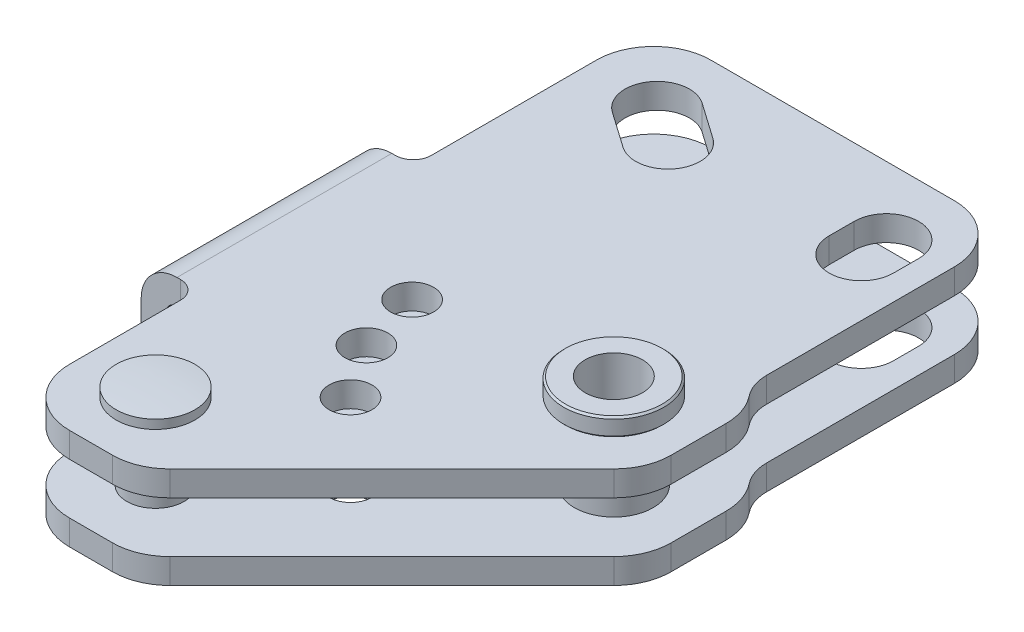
ISO-10303-21;
HEADER;
FILE_DESCRIPTION(('STEP AP214'),'2;1');
FILE_NAME('part.step','',(''),(''),'','','');
FILE_SCHEMA(('AUTOMOTIVE_DESIGN { 1 0 10303 214 1 1 1 1 }'));
ENDSEC;
DATA;
#1=APPLICATION_CONTEXT('core data for automotive mechanical design processes');
#2=APPLICATION_PROTOCOL_DEFINITION('international standard','automotive_design',2000,#1);
#3=PRODUCT_CONTEXT('',#1,'mechanical');
#4=PRODUCT('Part','Part','',(#3));
#5=PRODUCT_RELATED_PRODUCT_CATEGORY('part','',(#4));
#6=PRODUCT_DEFINITION_FORMATION('','',#4);
#7=PRODUCT_DEFINITION_CONTEXT('part definition',#1,'design');
#8=PRODUCT_DEFINITION('design','',#6,#7);
#9=PRODUCT_DEFINITION_SHAPE('','',#8);
#10=(LENGTH_UNIT() NAMED_UNIT(*) SI_UNIT(.MILLI.,.METRE.));
#11=(NAMED_UNIT(*) PLANE_ANGLE_UNIT() SI_UNIT($,.RADIAN.));
#12=(NAMED_UNIT(*) SI_UNIT($,.STERADIAN.) SOLID_ANGLE_UNIT());
#13=UNCERTAINTY_MEASURE_WITH_UNIT(LENGTH_MEASURE(1.E-05),#10,'distance_accuracy_value','');
#14=(GEOMETRIC_REPRESENTATION_CONTEXT(3) GLOBAL_UNCERTAINTY_ASSIGNED_CONTEXT((#13)) GLOBAL_UNIT_ASSIGNED_CONTEXT((#10,
#11,#12)) REPRESENTATION_CONTEXT('',''));
#15=CARTESIAN_POINT('',(0.,0.,0.));
#16=DIRECTION('',(0.,0.,1.));
#17=DIRECTION('',(1.,0.,0.));
#18=AXIS2_PLACEMENT_3D('',#15,#16,#17);
#19=CARTESIAN_POINT('',(32.3724829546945,-9.65,38.334271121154));
#20=DIRECTION('',(0.,1.,0.));
#21=DIRECTION('',(1.,0.,0.));
#22=AXIS2_PLACEMENT_3D('',#19,#20,#21);
#23=CYLINDRICAL_SURFACE('',#22,4.);
#24=CARTESIAN_POINT('',(32.3724829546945,-9.6,38.334271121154));
#25=DIRECTION('',(0.,-1.,0.));
#26=DIRECTION('',(0.,0.,1.));
#27=AXIS2_PLACEMENT_3D('',#24,#25,#26);
#28=CIRCLE('',#27,4.);
#29=CARTESIAN_POINT('',(32.3724829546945,-9.6,42.334271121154));
#30=VERTEX_POINT('',#29);
#31=EDGE_CURVE('E1854',#30,#30,#28,.T.);
#32=ORIENTED_EDGE('',*,*,#31,.T.);
#33=EDGE_LOOP('',(#32));
#34=FACE_BOUND('',#33,.T.);
#35=CARTESIAN_POINT('',(32.3724829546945,9.6,38.334271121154));
#36=DIRECTION('',(0.,1.,0.));
#37=DIRECTION('',(-1.,0.,0.));
#38=AXIS2_PLACEMENT_3D('',#35,#36,#37);
#39=CIRCLE('',#38,4.);
#40=CARTESIAN_POINT('',(28.3724829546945,9.6,38.334271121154));
#41=VERTEX_POINT('',#40);
#42=EDGE_CURVE('E1852',#41,#41,#39,.T.);
#43=ORIENTED_EDGE('',*,*,#42,.T.);
#44=EDGE_LOOP('',(#43));
#45=FACE_BOUND('',#44,.T.);
#46=ADVANCED_FACE('F14',(#34,#45),#23,.F.);
#47=CARTESIAN_POINT('',(32.3724829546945,-7.05,38.334271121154));
#48=DIRECTION('',(0.,-1.,0.));
#49=DIRECTION('',(-1.,0.,0.));
#50=AXIS2_PLACEMENT_3D('',#47,#48,#49);
#51=CYLINDRICAL_SURFACE('',#50,7.);
#52=CARTESIAN_POINT('',(32.3724829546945,-9.35,38.334271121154));
#53=DIRECTION('',(0.,-1.,0.));
#54=DIRECTION('',(1.,0.,0.));
#55=AXIS2_PLACEMENT_3D('',#52,#53,#54);
#56=CIRCLE('',#55,7.);
#57=CARTESIAN_POINT('',(39.3724829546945,-9.35,38.334271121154));
#58=VERTEX_POINT('',#57);
#59=EDGE_CURVE('E9',#58,#58,#56,.F.);
#60=ORIENTED_EDGE('',*,*,#59,.T.);
#61=EDGE_LOOP('',(#60));
#62=FACE_BOUND('',#61,.T.);
#63=CARTESIAN_POINT('',(32.3724829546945,-7.25,38.334271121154));
#64=DIRECTION('',(0.,-1.,0.));
#65=DIRECTION('',(-1.,0.,0.));
#66=AXIS2_PLACEMENT_3D('',#63,#64,#65);
#67=CIRCLE('',#66,7.);
#68=CARTESIAN_POINT('',(25.3724829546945,-7.25,38.334271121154));
#69=VERTEX_POINT('',#68);
#70=EDGE_CURVE('E1860',#69,#69,#67,.T.);
#71=ORIENTED_EDGE('',*,*,#70,.T.);
#72=EDGE_LOOP('',(#71));
#73=FACE_BOUND('',#72,.T.);
#74=ADVANCED_FACE('F432',(#62,#73),#51,.T.);
#75=CARTESIAN_POINT('',(32.3724829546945,-7.05,38.334271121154));
#76=DIRECTION('',(0.,-1.,0.));
#77=DIRECTION('',(-1.,0.,0.));
#78=AXIS2_PLACEMENT_3D('',#75,#76,#77);
#79=CONICAL_SURFACE('',#78,6.8,0.785398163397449);
#80=ORIENTED_EDGE('',*,*,#70,.F.);
#81=EDGE_LOOP('',(#80));
#82=FACE_BOUND('',#81,.T.);
#83=CARTESIAN_POINT('',(32.3724829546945,-7.05,38.334271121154));
#84=DIRECTION('',(0.,-1.,0.));
#85=DIRECTION('',(-1.,0.,0.));
#86=AXIS2_PLACEMENT_3D('',#83,#84,#85);
#87=CIRCLE('',#86,6.8);
#88=CARTESIAN_POINT('',(25.5724829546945,-7.05,38.334271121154));
#89=VERTEX_POINT('',#88);
#90=EDGE_CURVE('E413',#89,#89,#87,.T.);
#91=ORIENTED_EDGE('',*,*,#90,.T.);
#92=EDGE_LOOP('',(#91));
#93=FACE_BOUND('',#92,.T.);
#94=ADVANCED_FACE('F439',(#82,#93),#79,.T.);
#95=CARTESIAN_POINT('',(0.372482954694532,-5.95,70.334271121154));
#96=DIRECTION('',(0.,-1.,0.));
#97=DIRECTION('',(0.,0.,1.));
#98=AXIS2_PLACEMENT_3D('',#95,#96,#97);
#99=CONICAL_SURFACE('',#98,2.75,1.04719755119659);
#100=CARTESIAN_POINT('',(0.372482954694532,-4.3622867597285,70.334271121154));
#101=VERTEX_POINT('',#100);
#102=VERTEX_LOOP('',#101);
#103=FACE_BOUND('',#102,.T.);
#104=CARTESIAN_POINT('',(0.372482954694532,-5.95,70.334271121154));
#105=DIRECTION('',(0.,1.,0.));
#106=DIRECTION('',(0.,0.,-1.));
#107=AXIS2_PLACEMENT_3D('',#104,#105,#106);
#108=CIRCLE('',#107,2.75);
#109=CARTESIAN_POINT('',(0.372482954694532,-5.95,67.584271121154));
#110=VERTEX_POINT('',#109);
#111=EDGE_CURVE('E394',#110,#110,#108,.T.);
#112=ORIENTED_EDGE('',*,*,#111,.F.);
#113=EDGE_LOOP('',(#112));
#114=FACE_BOUND('',#113,.T.);
#115=ADVANCED_FACE('F448',(#103,#114),#99,.F.);
#116=CARTESIAN_POINT('',(32.3724829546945,-9.65,38.334271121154));
#117=DIRECTION('',(0.,1.,0.));
#118=DIRECTION('',(1.,0.,0.));
#119=AXIS2_PLACEMENT_3D('',#116,#117,#118);
#120=CYLINDRICAL_SURFACE('',#119,7.);
#121=CARTESIAN_POINT('',(32.3724829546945,9.35,38.334271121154));
#122=DIRECTION('',(0.,1.,0.));
#123=DIRECTION('',(-1.,0.,0.));
#124=AXIS2_PLACEMENT_3D('',#121,#122,#123);
#125=CIRCLE('',#124,7.);
#126=CARTESIAN_POINT('',(25.3724829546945,9.35,38.334271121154));
#127=VERTEX_POINT('',#126);
#128=EDGE_CURVE('E412',#127,#127,#125,.F.);
#129=ORIENTED_EDGE('',*,*,#128,.T.);
#130=EDGE_LOOP('',(#129));
#131=FACE_BOUND('',#130,.T.);
#132=CARTESIAN_POINT('',(32.3724829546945,7.3,38.334271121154));
#133=DIRECTION('',(0.,1.,0.));
#134=DIRECTION('',(1.,0.,0.));
#135=AXIS2_PLACEMENT_3D('',#132,#133,#134);
#136=CIRCLE('',#135,7.);
#137=CARTESIAN_POINT('',(39.3724829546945,7.3,38.334271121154));
#138=VERTEX_POINT('',#137);
#139=EDGE_CURVE('E809',#138,#138,#136,.T.);
#140=ORIENTED_EDGE('',*,*,#139,.T.);
#141=EDGE_LOOP('',(#140));
#142=FACE_BOUND('',#141,.T.);
#143=ADVANCED_FACE('F451',(#131,#142),#120,.T.);
#144=CARTESIAN_POINT('',(0.372482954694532,-51.4499999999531,70.3342711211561));
#145=DIRECTION('',(0.,1.,0.));
#146=DIRECTION('',(0.,0.,-1.));
#147=AXIS2_PLACEMENT_3D('',#144,#145,#146);
#148=SPHERICAL_SURFACE('',#147,59.9999999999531);
#149=CARTESIAN_POINT('',(0.372482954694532,8.2973848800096,70.334271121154));
#150=DIRECTION('',(0.,1.,0.));
#151=DIRECTION('',(0.,0.,-1.));
#152=AXIS2_PLACEMENT_3D('',#149,#150,#151);
#153=CIRCLE('',#152,5.5);
#154=CARTESIAN_POINT('',(0.372482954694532,8.2973848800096,64.834271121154));
#155=VERTEX_POINT('',#154);
#156=EDGE_CURVE('E1887',#155,#155,#153,.T.);
#157=ORIENTED_EDGE('',*,*,#156,.T.);
#158=EDGE_LOOP('',(#157));
#159=FACE_BOUND('',#158,.T.);
#160=ADVANCED_FACE('F456',(#159),#148,.T.);
#161=CARTESIAN_POINT('',(0.372482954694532,-4.3622867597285,70.334271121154));
#162=DIRECTION('',(0.,1.,0.));
#163=DIRECTION('',(0.,0.,-1.));
#164=AXIS2_PLACEMENT_3D('',#161,#162,#163);
#165=CYLINDRICAL_SURFACE('',#164,2.75);
#166=ORIENTED_EDGE('',*,*,#111,.T.);
#167=EDGE_LOOP('',(#166));
#168=FACE_BOUND('',#167,.T.);
#169=CARTESIAN_POINT('',(0.372482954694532,-8.3869460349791,70.334271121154));
#170=DIRECTION('',(0.,1.,0.));
#171=DIRECTION('',(0.,0.,-1.));
#172=AXIS2_PLACEMENT_3D('',#169,#170,#171);
#173=CIRCLE('',#172,2.75);
#174=CARTESIAN_POINT('',(0.372482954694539,-8.3869460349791,73.0842711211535));
#175=VERTEX_POINT('',#174);
#176=EDGE_CURVE('E1878',#175,#175,#173,.T.);
#177=ORIENTED_EDGE('',*,*,#176,.F.);
#178=EDGE_LOOP('',(#177));
#179=FACE_BOUND('',#178,.T.);
#180=ADVANCED_FACE('F452',(#168,#179),#165,.F.);
#181=CARTESIAN_POINT('',(32.3724829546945,7.05,38.334271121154));
#182=DIRECTION('',(0.,1.,0.));
#183=DIRECTION('',(1.,0.,0.));
#184=AXIS2_PLACEMENT_3D('',#181,#182,#183);
#185=CONICAL_SURFACE('',#184,6.75,0.785398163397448);
#186=ORIENTED_EDGE('',*,*,#139,.F.);
#187=EDGE_LOOP('',(#186));
#188=FACE_BOUND('',#187,.T.);
#189=CARTESIAN_POINT('',(32.3724829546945,7.05,38.334271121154));
#190=DIRECTION('',(0.,1.,0.));
#191=DIRECTION('',(1.,0.,0.));
#192=AXIS2_PLACEMENT_3D('',#189,#190,#191);
#193=CIRCLE('',#192,6.75);
#194=CARTESIAN_POINT('',(39.1224829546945,7.05,38.334271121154));
#195=VERTEX_POINT('',#194);
#196=EDGE_CURVE('E1868',#195,#195,#193,.T.);
#197=ORIENTED_EDGE('',*,*,#196,.T.);
#198=EDGE_LOOP('',(#197));
#199=FACE_BOUND('',#198,.T.);
#200=ADVANCED_FACE('F455',(#188,#199),#185,.T.);
#201=CARTESIAN_POINT('',(0.372482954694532,-4.3622867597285,70.334271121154));
#202=DIRECTION('',(0.,1.,0.));
#203=DIRECTION('',(0.,0.,-1.));
#204=AXIS2_PLACEMENT_3D('',#201,#202,#203);
#205=CYLINDRICAL_SURFACE('',#204,5.5);
#206=CARTESIAN_POINT('',(0.372482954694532,7.05,70.334271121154));
#207=DIRECTION('',(0.,1.,0.));
#208=DIRECTION('',(0.,0.,-1.));
#209=AXIS2_PLACEMENT_3D('',#206,#207,#208);
#210=CIRCLE('',#209,5.5);
#211=CARTESIAN_POINT('',(0.372482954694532,7.05,64.834271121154));
#212=VERTEX_POINT('',#211);
#213=EDGE_CURVE('E1884',#212,#212,#210,.T.);
#214=ORIENTED_EDGE('',*,*,#213,.T.);
#215=EDGE_LOOP('',(#214));
#216=FACE_BOUND('',#215,.T.);
#217=ORIENTED_EDGE('',*,*,#156,.F.);
#218=EDGE_LOOP('',(#217));
#219=FACE_BOUND('',#218,.T.);
#220=ADVANCED_FACE('F474',(#216,#219),#205,.T.);
#221=CARTESIAN_POINT('',(7.95306350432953,7.05,0.0877274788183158));
#222=DIRECTION('',(-0.573462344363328,0.,0.81923192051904));
#223=DIRECTION('',(0.819231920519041,0.,0.573462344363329));
#224=AXIS2_PLACEMENT_3D('',#221,#222,#223);
#225=PLANE('',#224);
#226=DIRECTION('',(0.,-1.,0.));
#227=VECTOR('',#226,1.);
#228=CARTESIAN_POINT('',(7.95306350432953,7.05,0.0877274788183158));
#229=LINE('',#228,#227);
#230=CARTESIAN_POINT('',(7.95306350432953,7.05,0.0877274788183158));
#231=VERTEX_POINT('',#230);
#232=CARTESIAN_POINT('',(7.95306350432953,3.55,0.0877274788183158));
#233=VERTEX_POINT('',#232);
#234=EDGE_CURVE('E1898',#231,#233,#229,.T.);
#235=ORIENTED_EDGE('',*,*,#234,.F.);
#236=DIRECTION('',(-0.81923192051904,0.,-0.573462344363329));
#237=VECTOR('',#236,1.);
#238=CARTESIAN_POINT('',(7.95306350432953,7.05,0.0877274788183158));
#239=LINE('',#238,#237);
#240=CARTESIAN_POINT('',(2.95306350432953,7.05,-3.41227252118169));
#241=VERTEX_POINT('',#240);
#242=EDGE_CURVE('E1893',#231,#241,#239,.T.);
#243=ORIENTED_EDGE('',*,*,#242,.T.);
#244=DIRECTION('',(0.,-1.,0.));
#245=VECTOR('',#244,1.);
#246=CARTESIAN_POINT('',(2.95306350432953,7.05,-3.41227252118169));
#247=LINE('',#246,#245);
#248=CARTESIAN_POINT('',(2.95306350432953,3.55,-3.41227252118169));
#249=VERTEX_POINT('',#248);
#250=EDGE_CURVE('E384',#241,#249,#247,.T.);
#251=ORIENTED_EDGE('',*,*,#250,.T.);
#252=DIRECTION('',(-0.81923192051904,0.,-0.573462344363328));
#253=VECTOR('',#252,1.);
#254=CARTESIAN_POINT('',(71.7731977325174,3.55,44.7618214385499));
#255=LINE('',#254,#253);
#256=EDGE_CURVE('E400',#233,#249,#255,.T.);
#257=ORIENTED_EDGE('',*,*,#256,.F.);
#258=EDGE_LOOP('',(#235,#243,#251,#257));
#259=FACE_BOUND('',#258,.T.);
#260=ADVANCED_FACE('F477',(#259),#225,.T.);
#261=CARTESIAN_POINT('',(5.37248295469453,7.05,3.77427112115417));
#262=DIRECTION('',(0.,-1.,0.));
#263=DIRECTION('',(1.,0.,0.));
#264=AXIS2_PLACEMENT_3D('',#261,#262,#263);
#265=CYLINDRICAL_SURFACE('',#264,4.50000000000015);
#266=DIRECTION('',(0.,-1.,0.));
#267=VECTOR('',#266,1.);
#268=CARTESIAN_POINT('',(2.79190240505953,7.05,7.46081476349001));
#269=LINE('',#268,#267);
#270=CARTESIAN_POINT('',(2.79190240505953,7.05,7.46081476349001));
#271=VERTEX_POINT('',#270);
#272=CARTESIAN_POINT('',(2.79190240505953,3.55,7.46081476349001));
#273=VERTEX_POINT('',#272);
#274=EDGE_CURVE('E391',#271,#273,#269,.T.);
#275=ORIENTED_EDGE('',*,*,#274,.F.);
#276=CARTESIAN_POINT('',(5.37248295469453,7.05,3.77427112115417));
#277=DIRECTION('',(0.,1.,0.));
#278=DIRECTION('',(-1.,0.,0.));
#279=AXIS2_PLACEMENT_3D('',#276,#277,#278);
#280=CIRCLE('',#279,4.50000000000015);
#281=EDGE_CURVE('E1856',#271,#231,#280,.T.);
#282=ORIENTED_EDGE('',*,*,#281,.T.);
#283=ORIENTED_EDGE('',*,*,#234,.T.);
#284=CARTESIAN_POINT('',(5.37248295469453,3.55,3.77427112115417));
#285=DIRECTION('',(0.,-1.,0.));
#286=DIRECTION('',(1.,0.,0.));
#287=AXIS2_PLACEMENT_3D('',#284,#285,#286);
#288=CIRCLE('',#287,4.50000000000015);
#289=EDGE_CURVE('E395',#273,#233,#288,.F.);
#290=ORIENTED_EDGE('',*,*,#289,.F.);
#291=EDGE_LOOP('',(#275,#282,#283,#290));
#292=FACE_BOUND('',#291,.T.);
#293=ADVANCED_FACE('F487',(#292),#265,.F.);
#294=CARTESIAN_POINT('',(-2.20809759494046,7.05,3.96081476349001));
#295=DIRECTION('',(0.573462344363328,0.,-0.819231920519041));
#296=DIRECTION('',(-0.819231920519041,0.,-0.573462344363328));
#297=AXIS2_PLACEMENT_3D('',#294,#295,#296);
#298=PLANE('',#297);
#299=DIRECTION('',(0.,-1.,0.));
#300=VECTOR('',#299,1.);
#301=CARTESIAN_POINT('',(-2.20809759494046,7.05,3.96081476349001));
#302=LINE('',#301,#300);
#303=CARTESIAN_POINT('',(-2.20809759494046,7.05,3.96081476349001));
#304=VERTEX_POINT('',#303);
#305=CARTESIAN_POINT('',(-2.20809759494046,3.55,3.96081476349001));
#306=VERTEX_POINT('',#305);
#307=EDGE_CURVE('E374',#304,#306,#302,.T.);
#308=ORIENTED_EDGE('',*,*,#307,.F.);
#309=DIRECTION('',(0.819231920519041,0.,0.573462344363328));
#310=VECTOR('',#309,1.);
#311=CARTESIAN_POINT('',(-2.20809759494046,7.05,3.96081476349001));
#312=LINE('',#311,#310);
#313=EDGE_CURVE('E1853',#304,#271,#312,.T.);
#314=ORIENTED_EDGE('',*,*,#313,.T.);
#315=ORIENTED_EDGE('',*,*,#274,.T.);
#316=DIRECTION('',(0.819231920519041,0.,0.573462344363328));
#317=VECTOR('',#316,1.);
#318=CARTESIAN_POINT('',(66.6120366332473,3.55,52.1349087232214));
#319=LINE('',#318,#317);
#320=EDGE_CURVE('E388',#306,#273,#319,.T.);
#321=ORIENTED_EDGE('',*,*,#320,.F.);
#322=EDGE_LOOP('',(#308,#314,#315,#321));
#323=FACE_BOUND('',#322,.T.);
#324=ADVANCED_FACE('F389',(#323),#298,.T.);
#325=CARTESIAN_POINT('',(0.372482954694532,7.05,0.274271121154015));
#326=DIRECTION('',(0.,-1.,0.));
#327=DIRECTION('',(1.,0.,0.));
#328=AXIS2_PLACEMENT_3D('',#325,#326,#327);
#329=CYLINDRICAL_SURFACE('',#328,4.50000000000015);
#330=ORIENTED_EDGE('',*,*,#250,.F.);
#331=CARTESIAN_POINT('',(0.372482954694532,7.05,0.274271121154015));
#332=DIRECTION('',(0.,1.,0.));
#333=DIRECTION('',(1.,0.,0.));
#334=AXIS2_PLACEMENT_3D('',#331,#332,#333);
#335=CIRCLE('',#334,4.50000000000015);
#336=EDGE_CURVE('E381',#241,#304,#335,.T.);
#337=ORIENTED_EDGE('',*,*,#336,.T.);
#338=ORIENTED_EDGE('',*,*,#307,.T.);
#339=CARTESIAN_POINT('',(0.372482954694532,3.55,0.274271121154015));
#340=DIRECTION('',(0.,-1.,0.));
#341=DIRECTION('',(1.,0.,0.));
#342=AXIS2_PLACEMENT_3D('',#339,#340,#341);
#343=CIRCLE('',#342,4.50000000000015);
#344=EDGE_CURVE('E378',#249,#306,#343,.F.);
#345=ORIENTED_EDGE('',*,*,#344,.F.);
#346=EDGE_LOOP('',(#330,#337,#338,#345));
#347=FACE_BOUND('',#346,.T.);
#348=ADVANCED_FACE('F376',(#347),#329,.F.);
#349=CARTESIAN_POINT('',(13.9877066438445,7.05,56.719047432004));
#350=DIRECTION('',(0.,-1.,0.));
#351=DIRECTION('',(1.,0.,0.));
#352=AXIS2_PLACEMENT_3D('',#349,#350,#351);
#353=CYLINDRICAL_SURFACE('',#352,3.);
#354=CARTESIAN_POINT('',(13.9877066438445,3.55,56.719047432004));
#355=DIRECTION('',(0.,-1.,0.));
#356=DIRECTION('',(1.,0.,0.));
#357=AXIS2_PLACEMENT_3D('',#354,#355,#356);
#358=CIRCLE('',#357,3.);
#359=CARTESIAN_POINT('',(16.9877066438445,3.55,56.719047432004));
#360=VERTEX_POINT('',#359);
#361=EDGE_CURVE('E835',#360,#360,#358,.F.);
#362=ORIENTED_EDGE('',*,*,#361,.F.);
#363=EDGE_LOOP('',(#362));
#364=FACE_BOUND('',#363,.T.);
#365=CARTESIAN_POINT('',(13.9877066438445,7.05,56.719047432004));
#366=DIRECTION('',(0.,1.,0.));
#367=DIRECTION('',(-1.,0.,0.));
#368=AXIS2_PLACEMENT_3D('',#365,#366,#367);
#369=CIRCLE('',#368,3.);
#370=CARTESIAN_POINT('',(10.9877066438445,7.05,56.719047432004));
#371=VERTEX_POINT('',#370);
#372=EDGE_CURVE('E838',#371,#371,#369,.T.);
#373=ORIENTED_EDGE('',*,*,#372,.T.);
#374=EDGE_LOOP('',(#373));
#375=FACE_BOUND('',#374,.T.);
#376=ADVANCED_FACE('F484',(#364,#375),#353,.F.);
#377=CARTESIAN_POINT('',(6.47142080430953,7.05,40.600320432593));
#378=DIRECTION('',(0.,-1.,0.));
#379=DIRECTION('',(1.,0.,0.));
#380=AXIS2_PLACEMENT_3D('',#377,#378,#379);
#381=CYLINDRICAL_SURFACE('',#380,3.);
#382=CARTESIAN_POINT('',(6.47142080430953,3.55,40.600320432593));
#383=DIRECTION('',(0.,-1.,0.));
#384=DIRECTION('',(1.,0.,0.));
#385=AXIS2_PLACEMENT_3D('',#382,#383,#384);
#386=CIRCLE('',#385,3.);
#387=CARTESIAN_POINT('',(9.47142080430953,3.55,40.600320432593));
#388=VERTEX_POINT('',#387);
#389=EDGE_CURVE('E819',#388,#388,#386,.F.);
#390=ORIENTED_EDGE('',*,*,#389,.F.);
#391=EDGE_LOOP('',(#390));
#392=FACE_BOUND('',#391,.T.);
#393=CARTESIAN_POINT('',(6.47142080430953,7.05,40.600320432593));
#394=DIRECTION('',(0.,1.,0.));
#395=DIRECTION('',(-1.,0.,0.));
#396=AXIS2_PLACEMENT_3D('',#393,#394,#395);
#397=CIRCLE('',#396,3.);
#398=CARTESIAN_POINT('',(3.47142080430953,7.05,40.600320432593));
#399=VERTEX_POINT('',#398);
#400=EDGE_CURVE('E822',#399,#399,#397,.T.);
#401=ORIENTED_EDGE('',*,*,#400,.T.);
#402=EDGE_LOOP('',(#401));
#403=FACE_BOUND('',#402,.T.);
#404=ADVANCED_FACE('F544',(#392,#403),#381,.F.);
#405=CARTESIAN_POINT('',(-1.62751704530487,-7.05,-1.22572887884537));
#406=DIRECTION('',(0.,1.,0.));
#407=DIRECTION('',(-1.,0.,0.));
#408=AXIS2_PLACEMENT_3D('',#405,#406,#407);
#409=CYLINDRICAL_SURFACE('',#408,8.00000000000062);
#410=DIRECTION('',(0.,1.,0.));
#411=VECTOR('',#410,1.);
#412=CARTESIAN_POINT('',(-1.62751704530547,-7.05,-9.22572887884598));
#413=LINE('',#412,#411);
#414=CARTESIAN_POINT('',(-1.62751704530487,3.55,-9.22572887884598));
#415=VERTEX_POINT('',#414);
#416=CARTESIAN_POINT('',(-1.62751704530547,7.05,-9.22572887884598));
#417=VERTEX_POINT('',#416);
#418=EDGE_CURVE('E768',#415,#417,#413,.T.);
#419=ORIENTED_EDGE('',*,*,#418,.F.);
#420=CARTESIAN_POINT('',(-1.62751704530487,3.55,-1.22572887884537));
#421=DIRECTION('',(0.,-1.,0.));
#422=DIRECTION('',(1.,0.,0.));
#423=AXIS2_PLACEMENT_3D('',#420,#421,#422);
#424=CIRCLE('',#423,8.00000000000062);
#425=CARTESIAN_POINT('',(-9.62751704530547,3.55,-1.22572887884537));
#426=VERTEX_POINT('',#425);
#427=EDGE_CURVE('E1033',#415,#426,#424,.F.);
#428=ORIENTED_EDGE('',*,*,#427,.T.);
#429=DIRECTION('',(0.,1.,0.));
#430=VECTOR('',#429,1.);
#431=CARTESIAN_POINT('',(-9.62751704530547,-7.05,-1.22572887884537));
#432=LINE('',#431,#430);
#433=CARTESIAN_POINT('',(-9.62751704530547,7.05,-1.22572887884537));
#434=VERTEX_POINT('',#433);
#435=EDGE_CURVE('E764',#426,#434,#432,.T.);
#436=ORIENTED_EDGE('',*,*,#435,.T.);
#437=CARTESIAN_POINT('',(-1.62751704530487,7.05,-1.22572887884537));
#438=DIRECTION('',(0.,1.,0.));
#439=DIRECTION('',(1.,0.,0.));
#440=AXIS2_PLACEMENT_3D('',#437,#438,#439);
#441=CIRCLE('',#440,8.00000000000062);
#442=EDGE_CURVE('E1105',#417,#434,#441,.T.);
#443=ORIENTED_EDGE('',*,*,#442,.F.);
#444=EDGE_LOOP('',(#419,#428,#436,#443));
#445=FACE_BOUND('',#444,.T.);
#446=ADVANCED_FACE('F560',(#445),#409,.T.);
#447=CARTESIAN_POINT('',(-9.62751704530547,-7.05,-1.22572887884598));
#448=DIRECTION('',(-1.,0.,0.));
#449=DIRECTION('',(0.,-1.,0.));
#450=AXIS2_PLACEMENT_3D('',#447,#448,#449);
#451=PLANE('',#450);
#452=ORIENTED_EDGE('',*,*,#435,.F.);
#453=DIRECTION('',(0.,0.,1.));
#454=VECTOR('',#453,1.);
#455=CARTESIAN_POINT('',(-9.62751704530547,3.55,-1.22572887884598));
#456=LINE('',#455,#454);
#457=CARTESIAN_POINT('',(-9.62751704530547,3.55,21.8342711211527));
#458=VERTEX_POINT('',#457);
#459=EDGE_CURVE('E1030',#426,#458,#456,.T.);
#460=ORIENTED_EDGE('',*,*,#459,.T.);
#461=DIRECTION('',(0.,1.,0.));
#462=VECTOR('',#461,1.);
#463=CARTESIAN_POINT('',(-9.62751704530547,-7.05,21.834271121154));
#464=LINE('',#463,#462);
#465=CARTESIAN_POINT('',(-9.62751704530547,7.05,21.834271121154));
#466=VERTEX_POINT('',#465);
#467=EDGE_CURVE('E760',#458,#466,#464,.T.);
#468=ORIENTED_EDGE('',*,*,#467,.T.);
#469=DIRECTION('',(0.,0.,1.));
#470=VECTOR('',#469,1.);
#471=CARTESIAN_POINT('',(-9.62751704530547,7.05,-1.22572887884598));
#472=LINE('',#471,#470);
#473=EDGE_CURVE('E1107',#434,#466,#472,.T.);
#474=ORIENTED_EDGE('',*,*,#473,.F.);
#475=EDGE_LOOP('',(#452,#460,#468,#474));
#476=FACE_BOUND('',#475,.T.);
#477=ADVANCED_FACE('F657',(#476),#451,.T.);
#478=CARTESIAN_POINT('',(-9.62751704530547,-7.05,56.834271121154));
#479=DIRECTION('',(-1.,0.,0.));
#480=DIRECTION('',(0.,-1.,0.));
#481=AXIS2_PLACEMENT_3D('',#478,#479,#480);
#482=PLANE('',#481);
#483=DIRECTION('',(0.,1.,0.));
#484=VECTOR('',#483,1.);
#485=CARTESIAN_POINT('',(-9.62751704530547,-7.05,56.834271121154));
#486=LINE('',#485,#484);
#487=CARTESIAN_POINT('',(-9.62751704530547,3.55,56.834271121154));
#488=VERTEX_POINT('',#487);
#489=CARTESIAN_POINT('',(-9.62751704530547,7.05,56.834271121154));
#490=VERTEX_POINT('',#489);
#491=EDGE_CURVE('E742',#488,#490,#486,.T.);
#492=ORIENTED_EDGE('',*,*,#491,.F.);
#493=DIRECTION('',(0.,0.,1.));
#494=VECTOR('',#493,1.);
#495=CARTESIAN_POINT('',(-9.62751704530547,3.55,56.834271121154));
#496=LINE('',#495,#494);
#497=CARTESIAN_POINT('',(-9.62751704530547,3.55,72.334271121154));
#498=VERTEX_POINT('',#497);
#499=EDGE_CURVE('E1015',#488,#498,#496,.T.);
#500=ORIENTED_EDGE('',*,*,#499,.T.);
#501=DIRECTION('',(0.,1.,0.));
#502=VECTOR('',#501,1.);
#503=CARTESIAN_POINT('',(-9.62751704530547,-7.05,72.334271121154));
#504=LINE('',#503,#502);
#505=CARTESIAN_POINT('',(-9.62751704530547,7.05,72.334271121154));
#506=VERTEX_POINT('',#505);
#507=EDGE_CURVE('E738',#498,#506,#504,.T.);
#508=ORIENTED_EDGE('',*,*,#507,.T.);
#509=DIRECTION('',(0.,0.,1.));
#510=VECTOR('',#509,1.);
#511=CARTESIAN_POINT('',(-9.62751704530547,7.05,56.834271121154));
#512=LINE('',#511,#510);
#513=EDGE_CURVE('E1121',#490,#506,#512,.T.);
#514=ORIENTED_EDGE('',*,*,#513,.F.);
#515=EDGE_LOOP('',(#492,#500,#508,#514));
#516=FACE_BOUND('',#515,.T.);
#517=ADVANCED_FACE('F637',(#516),#482,.T.);
#518=CARTESIAN_POINT('',(-1.62751704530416,-7.05,72.3342711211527));
#519=DIRECTION('',(0.,1.,0.));
#520=DIRECTION('',(-1.,0.,0.));
#521=AXIS2_PLACEMENT_3D('',#518,#519,#520);
#522=CYLINDRICAL_SURFACE('',#521,8.00000000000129);
#523=ORIENTED_EDGE('',*,*,#507,.F.);
#524=CARTESIAN_POINT('',(-1.62751704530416,3.55,72.3342711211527));
#525=DIRECTION('',(0.,-1.,0.));
#526=DIRECTION('',(1.,0.,0.));
#527=AXIS2_PLACEMENT_3D('',#524,#525,#526);
#528=CIRCLE('',#527,8.00000000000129);
#529=CARTESIAN_POINT('',(-1.62751704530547,3.55,80.334271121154));
#530=VERTEX_POINT('',#529);
#531=EDGE_CURVE('E1012',#498,#530,#528,.F.);
#532=ORIENTED_EDGE('',*,*,#531,.T.);
#533=DIRECTION('',(0.,1.,0.));
#534=VECTOR('',#533,1.);
#535=CARTESIAN_POINT('',(-1.62751704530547,-7.05,80.334271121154));
#536=LINE('',#535,#534);
#537=CARTESIAN_POINT('',(-1.62751704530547,7.05,80.334271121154));
#538=VERTEX_POINT('',#537);
#539=EDGE_CURVE('E734',#530,#538,#536,.T.);
#540=ORIENTED_EDGE('',*,*,#539,.T.);
#541=CARTESIAN_POINT('',(-1.62751704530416,7.05,72.3342711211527));
#542=DIRECTION('',(0.,1.,0.));
#543=DIRECTION('',(-1.,0.,0.));
#544=AXIS2_PLACEMENT_3D('',#541,#542,#543);
#545=CIRCLE('',#544,8.00000000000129);
#546=EDGE_CURVE('E1124',#506,#538,#545,.T.);
#547=ORIENTED_EDGE('',*,*,#546,.F.);
#548=EDGE_LOOP('',(#523,#532,#540,#547));
#549=FACE_BOUND('',#548,.T.);
#550=ADVANCED_FACE('F632',(#549),#522,.T.);
#551=CARTESIAN_POINT('',(-1.62751704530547,-7.05,80.334271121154));
#552=DIRECTION('',(0.,0.,1.));
#553=DIRECTION('',(0.,1.,0.));
#554=AXIS2_PLACEMENT_3D('',#551,#552,#553);
#555=PLANE('',#554);
#556=ORIENTED_EDGE('',*,*,#539,.F.);
#557=DIRECTION('',(-1.,0.,0.));
#558=VECTOR('',#557,1.);
#559=CARTESIAN_POINT('',(46.8724829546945,3.55,80.334271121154));
#560=LINE('',#559,#558);
#561=CARTESIAN_POINT('',(4.37248295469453,3.55,80.334271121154));
#562=VERTEX_POINT('',#561);
#563=EDGE_CURVE('E978',#562,#530,#560,.T.);
#564=ORIENTED_EDGE('',*,*,#563,.F.);
#565=DIRECTION('',(0.,1.,0.));
#566=VECTOR('',#565,1.);
#567=CARTESIAN_POINT('',(4.37248295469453,-7.05,80.334271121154));
#568=LINE('',#567,#566);
#569=CARTESIAN_POINT('',(4.37248295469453,7.05,80.334271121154));
#570=VERTEX_POINT('',#569);
#571=EDGE_CURVE('E730',#562,#570,#568,.T.);
#572=ORIENTED_EDGE('',*,*,#571,.T.);
#573=DIRECTION('',(1.,0.,0.));
#574=VECTOR('',#573,1.);
#575=CARTESIAN_POINT('',(-1.62751704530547,7.05,80.334271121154));
#576=LINE('',#575,#574);
#577=EDGE_CURVE('E1126',#538,#570,#576,.T.);
#578=ORIENTED_EDGE('',*,*,#577,.F.);
#579=EDGE_LOOP('',(#556,#564,#572,#578));
#580=FACE_BOUND('',#579,.T.);
#581=ADVANCED_FACE('F627',(#580),#555,.T.);
#582=CARTESIAN_POINT('',(4.37248295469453,-7.05,72.3342711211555));
#583=DIRECTION('',(0.,1.,0.));
#584=DIRECTION('',(-1.,0.,0.));
#585=AXIS2_PLACEMENT_3D('',#582,#583,#584);
#586=CYLINDRICAL_SURFACE('',#585,7.99999999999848);
#587=ORIENTED_EDGE('',*,*,#571,.F.);
#588=CARTESIAN_POINT('',(4.37248295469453,3.55,72.3342711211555));
#589=DIRECTION('',(0.,-1.,0.));
#590=DIRECTION('',(1.,0.,0.));
#591=AXIS2_PLACEMENT_3D('',#588,#589,#590);
#592=CIRCLE('',#591,7.99999999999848);
#593=CARTESIAN_POINT('',(10.0293372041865,3.55,77.991125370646));
#594=VERTEX_POINT('',#593);
#595=EDGE_CURVE('E996',#562,#594,#592,.F.);
#596=ORIENTED_EDGE('',*,*,#595,.T.);
#597=DIRECTION('',(0.,1.,0.));
#598=VECTOR('',#597,1.);
#599=CARTESIAN_POINT('',(10.0293372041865,-7.05,77.991125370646));
#600=LINE('',#599,#598);
#601=CARTESIAN_POINT('',(10.0293372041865,7.05,77.991125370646));
#602=VERTEX_POINT('',#601);
#603=EDGE_CURVE('E726',#594,#602,#600,.T.);
#604=ORIENTED_EDGE('',*,*,#603,.T.);
#605=CARTESIAN_POINT('',(4.37248295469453,7.05,72.3342711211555));
#606=DIRECTION('',(0.,1.,0.));
#607=DIRECTION('',(-1.,0.,0.));
#608=AXIS2_PLACEMENT_3D('',#605,#606,#607);
#609=CIRCLE('',#608,7.99999999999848);
#610=EDGE_CURVE('E1129',#570,#602,#609,.T.);
#611=ORIENTED_EDGE('',*,*,#610,.F.);
#612=EDGE_LOOP('',(#587,#596,#604,#611));
#613=FACE_BOUND('',#612,.T.);
#614=ADVANCED_FACE('F622',(#613),#586,.T.);
#615=CARTESIAN_POINT('',(10.0293372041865,-7.05,77.991125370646));
#616=DIRECTION('',(0.707106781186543,0.,0.707106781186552));
#617=DIRECTION('',(0.707106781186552,0.,-0.707106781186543));
#618=AXIS2_PLACEMENT_3D('',#615,#616,#617);
#619=PLANE('',#618);
#620=ORIENTED_EDGE('',*,*,#603,.F.);
#621=DIRECTION('',(0.707106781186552,0.,-0.707106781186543));
#622=VECTOR('',#621,1.);
#623=CARTESIAN_POINT('',(10.0293372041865,3.55,77.991125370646));
#624=LINE('',#623,#622);
#625=CARTESIAN_POINT('',(41.0293372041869,3.55,46.991125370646));
#626=VERTEX_POINT('',#625);
#627=EDGE_CURVE('E993',#594,#626,#624,.T.);
#628=ORIENTED_EDGE('',*,*,#627,.T.);
#629=DIRECTION('',(0.,1.,0.));
#630=VECTOR('',#629,1.);
#631=CARTESIAN_POINT('',(41.0293372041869,-7.05,46.991125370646));
#632=LINE('',#631,#630);
#633=CARTESIAN_POINT('',(41.0293372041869,7.05,46.991125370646));
#634=VERTEX_POINT('',#633);
#635=EDGE_CURVE('E716',#626,#634,#632,.T.);
#636=ORIENTED_EDGE('',*,*,#635,.T.);
#637=DIRECTION('',(0.707106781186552,0.,-0.707106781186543));
#638=VECTOR('',#637,1.);
#639=CARTESIAN_POINT('',(10.0293372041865,7.05,77.991125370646));
#640=LINE('',#639,#638);
#641=EDGE_CURVE('E1132',#602,#634,#640,.T.);
#642=ORIENTED_EDGE('',*,*,#641,.F.);
#643=EDGE_LOOP('',(#620,#628,#636,#642));
#644=FACE_BOUND('',#643,.T.);
#645=ADVANCED_FACE('F617',(#644),#619,.T.);
#646=CARTESIAN_POINT('',(35.3724829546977,-7.05,41.3342711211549));
#647=DIRECTION('',(0.,1.,0.));
#648=DIRECTION('',(-1.,0.,0.));
#649=AXIS2_PLACEMENT_3D('',#646,#647,#648);
#650=CYLINDRICAL_SURFACE('',#649,7.99999999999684);
#651=ORIENTED_EDGE('',*,*,#635,.F.);
#652=CARTESIAN_POINT('',(35.3724829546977,3.55,41.3342711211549));
#653=DIRECTION('',(0.,-1.,0.));
#654=DIRECTION('',(1.,0.,0.));
#655=AXIS2_PLACEMENT_3D('',#652,#653,#654);
#656=CIRCLE('',#655,7.99999999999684);
#657=CARTESIAN_POINT('',(43.3724829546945,3.55,41.334271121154));
#658=VERTEX_POINT('',#657);
#659=EDGE_CURVE('E791',#626,#658,#656,.F.);
#660=ORIENTED_EDGE('',*,*,#659,.T.);
#661=DIRECTION('',(0.,1.,0.));
#662=VECTOR('',#661,1.);
#663=CARTESIAN_POINT('',(43.3724829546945,-7.05,41.334271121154));
#664=LINE('',#663,#662);
#665=CARTESIAN_POINT('',(43.3724829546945,7.05,41.334271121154));
#666=VERTEX_POINT('',#665);
#667=EDGE_CURVE('E704',#658,#666,#664,.T.);
#668=ORIENTED_EDGE('',*,*,#667,.T.);
#669=CARTESIAN_POINT('',(35.3724829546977,7.05,41.3342711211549));
#670=DIRECTION('',(0.,1.,0.));
#671=DIRECTION('',(-1.,0.,0.));
#672=AXIS2_PLACEMENT_3D('',#669,#670,#671);
#673=CIRCLE('',#672,7.99999999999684);
#674=EDGE_CURVE('E1135',#634,#666,#673,.T.);
#675=ORIENTED_EDGE('',*,*,#674,.F.);
#676=EDGE_LOOP('',(#651,#660,#668,#675));
#677=FACE_BOUND('',#676,.T.);
#678=ADVANCED_FACE('F612',(#677),#650,.T.);
#679=CARTESIAN_POINT('',(43.3724829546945,-7.05,41.334271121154));
#680=DIRECTION('',(1.,0.,0.));
#681=DIRECTION('',(0.,1.,0.));
#682=AXIS2_PLACEMENT_3D('',#679,#680,#681);
#683=PLANE('',#682);
#684=ORIENTED_EDGE('',*,*,#667,.F.);
#685=DIRECTION('',(0.,0.,-1.));
#686=VECTOR('',#685,1.);
#687=CARTESIAN_POINT('',(43.3724829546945,3.55,41.334271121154));
#688=LINE('',#687,#686);
#689=CARTESIAN_POINT('',(43.3724829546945,3.55,33.664271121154));
#690=VERTEX_POINT('',#689);
#691=EDGE_CURVE('E705',#658,#690,#688,.T.);
#692=ORIENTED_EDGE('',*,*,#691,.T.);
#693=DIRECTION('',(0.,1.,0.));
#694=VECTOR('',#693,1.);
#695=CARTESIAN_POINT('',(43.3724829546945,-7.05,33.664271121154));
#696=LINE('',#695,#694);
#697=CARTESIAN_POINT('',(43.3724829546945,7.05,33.664271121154));
#698=VERTEX_POINT('',#697);
#699=EDGE_CURVE('E788',#690,#698,#696,.T.);
#700=ORIENTED_EDGE('',*,*,#699,.T.);
#701=DIRECTION('',(0.,0.,-1.));
#702=VECTOR('',#701,1.);
#703=CARTESIAN_POINT('',(43.3724829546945,7.05,41.334271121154));
#704=LINE('',#703,#702);
#705=EDGE_CURVE('E708',#666,#698,#704,.T.);
#706=ORIENTED_EDGE('',*,*,#705,.F.);
#707=EDGE_LOOP('',(#684,#692,#700,#706));
#708=FACE_BOUND('',#707,.T.);
#709=ADVANCED_FACE('F687',(#708),#683,.T.);
#710=CARTESIAN_POINT('',(35.3724829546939,-7.05,33.664271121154));
#711=DIRECTION('',(0.,1.,0.));
#712=DIRECTION('',(-1.,0.,0.));
#713=AXIS2_PLACEMENT_3D('',#710,#711,#712);
#714=CYLINDRICAL_SURFACE('',#713,8.00000000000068);
#715=ORIENTED_EDGE('',*,*,#699,.F.);
#716=CARTESIAN_POINT('',(35.3724829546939,3.55,33.664271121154));
#717=DIRECTION('',(0.,-1.,0.));
#718=DIRECTION('',(1.,0.,0.));
#719=AXIS2_PLACEMENT_3D('',#716,#717,#718);
#720=CIRCLE('',#719,8.00000000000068);
#721=CARTESIAN_POINT('',(41.6581972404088,3.55,28.7155545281));
#722=VERTEX_POINT('',#721);
#723=EDGE_CURVE('E1000',#690,#722,#720,.F.);
#724=ORIENTED_EDGE('',*,*,#723,.T.);
#725=DIRECTION('',(0.,1.,0.));
#726=VECTOR('',#725,1.);
#727=CARTESIAN_POINT('',(41.6581972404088,-7.05,28.7155545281));
#728=LINE('',#727,#726);
#729=CARTESIAN_POINT('',(41.6581972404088,7.05,28.7155545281));
#730=VERTEX_POINT('',#729);
#731=EDGE_CURVE('E784',#722,#730,#728,.T.);
#732=ORIENTED_EDGE('',*,*,#731,.T.);
#733=CARTESIAN_POINT('',(35.3724829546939,7.05,33.664271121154));
#734=DIRECTION('',(0.,1.,0.));
#735=DIRECTION('',(-1.,0.,0.));
#736=AXIS2_PLACEMENT_3D('',#733,#734,#735);
#737=CIRCLE('',#736,8.00000000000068);
#738=EDGE_CURVE('E1090',#698,#730,#737,.T.);
#739=ORIENTED_EDGE('',*,*,#738,.F.);
#740=EDGE_LOOP('',(#715,#724,#732,#739));
#741=FACE_BOUND('',#740,.T.);
#742=ADVANCED_FACE('F684',(#741),#714,.T.);
#743=CARTESIAN_POINT('',(46.3724829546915,-7.05,25.0040170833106));
#744=DIRECTION('',(0.,1.,0.));
#745=DIRECTION('',(-1.,0.,0.));
#746=AXIS2_PLACEMENT_3D('',#743,#744,#745);
#747=CYLINDRICAL_SURFACE('',#746,5.99999999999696);
#748=ORIENTED_EDGE('',*,*,#731,.F.);
#749=CARTESIAN_POINT('',(46.3724829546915,3.55,25.0040170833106));
#750=DIRECTION('',(0.,-1.,0.));
#751=DIRECTION('',(1.,0.,0.));
#752=AXIS2_PLACEMENT_3D('',#749,#750,#751);
#753=CIRCLE('',#752,5.99999999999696);
#754=CARTESIAN_POINT('',(40.3724829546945,3.55,25.00401708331));
#755=VERTEX_POINT('',#754);
#756=EDGE_CURVE('E1003',#722,#755,#753,.T.);
#757=ORIENTED_EDGE('',*,*,#756,.T.);
#758=DIRECTION('',(0.,1.,0.));
#759=VECTOR('',#758,1.);
#760=CARTESIAN_POINT('',(40.3724829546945,-7.05,25.00401708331));
#761=LINE('',#760,#759);
#762=CARTESIAN_POINT('',(40.3724829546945,7.05,25.00401708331));
#763=VERTEX_POINT('',#762);
#764=EDGE_CURVE('E780',#755,#763,#761,.T.);
#765=ORIENTED_EDGE('',*,*,#764,.T.);
#766=CARTESIAN_POINT('',(46.3724829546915,7.05,25.0040170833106));
#767=DIRECTION('',(0.,-1.,0.));
#768=DIRECTION('',(1.,0.,0.));
#769=AXIS2_PLACEMENT_3D('',#766,#767,#768);
#770=CIRCLE('',#769,5.99999999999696);
#771=EDGE_CURVE('E1093',#730,#763,#770,.T.);
#772=ORIENTED_EDGE('',*,*,#771,.F.);
#773=EDGE_LOOP('',(#748,#757,#765,#772));
#774=FACE_BOUND('',#773,.T.);
#775=ADVANCED_FACE('F680',(#774),#747,.F.);
#776=CARTESIAN_POINT('',(40.3724829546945,-7.05,25.00401708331));
#777=DIRECTION('',(1.,0.,0.));
#778=DIRECTION('',(0.,1.,0.));
#779=AXIS2_PLACEMENT_3D('',#776,#777,#778);
#780=PLANE('',#779);
#781=ORIENTED_EDGE('',*,*,#764,.F.);
#782=DIRECTION('',(0.,0.,-1.));
#783=VECTOR('',#782,1.);
#784=CARTESIAN_POINT('',(40.3724829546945,3.55,25.00401708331));
#785=LINE('',#784,#783);
#786=CARTESIAN_POINT('',(40.3724829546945,3.55,-1.22572887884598));
#787=VERTEX_POINT('',#786);
#788=EDGE_CURVE('E1006',#755,#787,#785,.T.);
#789=ORIENTED_EDGE('',*,*,#788,.T.);
#790=DIRECTION('',(0.,1.,0.));
#791=VECTOR('',#790,1.);
#792=CARTESIAN_POINT('',(40.3724829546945,-7.05,-1.22572887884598));
#793=LINE('',#792,#791);
#794=CARTESIAN_POINT('',(40.3724829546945,7.05,-1.22572887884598));
#795=VERTEX_POINT('',#794);
#796=EDGE_CURVE('E776',#787,#795,#793,.T.);
#797=ORIENTED_EDGE('',*,*,#796,.T.);
#798=DIRECTION('',(0.,0.,-1.));
#799=VECTOR('',#798,1.);
#800=CARTESIAN_POINT('',(40.3724829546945,7.05,25.00401708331));
#801=LINE('',#800,#799);
#802=EDGE_CURVE('E1096',#763,#795,#801,.T.);
#803=ORIENTED_EDGE('',*,*,#802,.F.);
#804=EDGE_LOOP('',(#781,#789,#797,#803));
#805=FACE_BOUND('',#804,.T.);
#806=ADVANCED_FACE('F675',(#805),#780,.T.);
#807=CARTESIAN_POINT('',(32.3724829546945,-7.05,-1.22572887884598));
#808=DIRECTION('',(0.,1.,0.));
#809=DIRECTION('',(-1.,0.,0.));
#810=AXIS2_PLACEMENT_3D('',#807,#808,#809);
#811=CYLINDRICAL_SURFACE('',#810,8.);
#812=ORIENTED_EDGE('',*,*,#796,.F.);
#813=CARTESIAN_POINT('',(32.3724829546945,3.55,-1.22572887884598));
#814=DIRECTION('',(0.,-1.,0.));
#815=DIRECTION('',(1.,0.,0.));
#816=AXIS2_PLACEMENT_3D('',#813,#814,#815);
#817=CIRCLE('',#816,8.);
#818=CARTESIAN_POINT('',(32.3724829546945,3.55,-9.22572887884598));
#819=VERTEX_POINT('',#818);
#820=EDGE_CURVE('E1009',#787,#819,#817,.F.);
#821=ORIENTED_EDGE('',*,*,#820,.T.);
#822=DIRECTION('',(0.,1.,0.));
#823=VECTOR('',#822,1.);
#824=CARTESIAN_POINT('',(32.3724829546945,-7.05,-9.22572887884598));
#825=LINE('',#824,#823);
#826=CARTESIAN_POINT('',(32.3724829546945,7.05,-9.22572887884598));
#827=VERTEX_POINT('',#826);
#828=EDGE_CURVE('E772',#819,#827,#825,.T.);
#829=ORIENTED_EDGE('',*,*,#828,.T.);
#830=CARTESIAN_POINT('',(32.3724829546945,7.05,-1.22572887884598));
#831=DIRECTION('',(0.,1.,0.));
#832=DIRECTION('',(-1.,0.,0.));
#833=AXIS2_PLACEMENT_3D('',#830,#831,#832);
#834=CIRCLE('',#833,8.);
#835=EDGE_CURVE('E1099',#795,#827,#834,.T.);
#836=ORIENTED_EDGE('',*,*,#835,.F.);
#837=EDGE_LOOP('',(#812,#821,#829,#836));
#838=FACE_BOUND('',#837,.T.);
#839=ADVANCED_FACE('F670',(#838),#811,.T.);
#840=CARTESIAN_POINT('',(32.3724829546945,-7.05,-9.22572887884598));
#841=DIRECTION('',(0.,0.,-1.));
#842=DIRECTION('',(0.,-1.,0.));
#843=AXIS2_PLACEMENT_3D('',#840,#841,#842);
#844=PLANE('',#843);
#845=ORIENTED_EDGE('',*,*,#828,.F.);
#846=DIRECTION('',(-1.,0.,0.));
#847=VECTOR('',#846,1.);
#848=CARTESIAN_POINT('',(46.8724829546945,3.55,-9.22572887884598));
#849=LINE('',#848,#847);
#850=EDGE_CURVE('E970',#819,#415,#849,.T.);
#851=ORIENTED_EDGE('',*,*,#850,.T.);
#852=ORIENTED_EDGE('',*,*,#418,.T.);
#853=DIRECTION('',(-1.,0.,0.));
#854=VECTOR('',#853,1.);
#855=CARTESIAN_POINT('',(32.3724829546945,7.05,-9.22572887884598));
#856=LINE('',#855,#854);
#857=EDGE_CURVE('E1102',#827,#417,#856,.T.);
#858=ORIENTED_EDGE('',*,*,#857,.F.);
#859=EDGE_LOOP('',(#845,#851,#852,#858));
#860=FACE_BOUND('',#859,.T.);
#861=ADVANCED_FACE('F552',(#860),#844,.T.);
#862=CARTESIAN_POINT('',(8.80848049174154,7.05,49.322345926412));
#863=DIRECTION('',(0.,-1.,0.));
#864=DIRECTION('',(1.,0.,0.));
#865=AXIS2_PLACEMENT_3D('',#862,#863,#864);
#866=CYLINDRICAL_SURFACE('',#865,3.);
#867=CARTESIAN_POINT('',(8.80848049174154,3.55,49.322345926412));
#868=DIRECTION('',(0.,-1.,0.));
#869=DIRECTION('',(1.,0.,0.));
#870=AXIS2_PLACEMENT_3D('',#867,#868,#869);
#871=CIRCLE('',#870,3.);
#872=CARTESIAN_POINT('',(11.8084804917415,3.55,49.322345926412));
#873=VERTEX_POINT('',#872);
#874=EDGE_CURVE('E827',#873,#873,#871,.F.);
#875=ORIENTED_EDGE('',*,*,#874,.F.);
#876=EDGE_LOOP('',(#875));
#877=FACE_BOUND('',#876,.T.);
#878=CARTESIAN_POINT('',(8.80848049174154,7.05,49.322345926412));
#879=DIRECTION('',(0.,1.,0.));
#880=DIRECTION('',(-1.,0.,0.));
#881=AXIS2_PLACEMENT_3D('',#878,#879,#880);
#882=CIRCLE('',#881,3.);
#883=CARTESIAN_POINT('',(5.80848049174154,7.05,49.322345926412));
#884=VERTEX_POINT('',#883);
#885=EDGE_CURVE('E830',#884,#884,#882,.T.);
#886=ORIENTED_EDGE('',*,*,#885,.T.);
#887=EDGE_LOOP('',(#886));
#888=FACE_BOUND('',#887,.T.);
#889=ADVANCED_FACE('F518',(#877,#888),#866,.F.);
#890=CARTESIAN_POINT('',(32.3724829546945,7.05,0.274271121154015));
#891=DIRECTION('',(0.,-1.,0.));
#892=DIRECTION('',(1.,0.,0.));
#893=AXIS2_PLACEMENT_3D('',#890,#891,#892);
#894=CYLINDRICAL_SURFACE('',#893,4.5);
#895=DIRECTION('',(0.,-1.,0.));
#896=VECTOR('',#895,1.);
#897=CARTESIAN_POINT('',(36.8724829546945,7.05,0.274271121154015));
#898=LINE('',#897,#896);
#899=CARTESIAN_POINT('',(36.8724829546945,7.05,0.274271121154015));
#900=VERTEX_POINT('',#899);
#901=CARTESIAN_POINT('',(36.8724829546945,3.55,0.274271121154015));
#902=VERTEX_POINT('',#901);
#903=EDGE_CURVE('E907',#900,#902,#898,.T.);
#904=ORIENTED_EDGE('',*,*,#903,.F.);
#905=CARTESIAN_POINT('',(32.3724829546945,7.05,0.274271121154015));
#906=DIRECTION('',(0.,1.,0.));
#907=DIRECTION('',(1.,0.,0.));
#908=AXIS2_PLACEMENT_3D('',#905,#906,#907);
#909=CIRCLE('',#908,4.5);
#910=CARTESIAN_POINT('',(27.8724829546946,7.05,0.274271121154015));
#911=VERTEX_POINT('',#910);
#912=EDGE_CURVE('E896',#900,#911,#909,.T.);
#913=ORIENTED_EDGE('',*,*,#912,.T.);
#914=DIRECTION('',(0.,-1.,0.));
#915=VECTOR('',#914,1.);
#916=CARTESIAN_POINT('',(27.8724829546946,7.05,0.274271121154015));
#917=LINE('',#916,#915);
#918=CARTESIAN_POINT('',(27.8724829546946,3.55,0.274271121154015));
#919=VERTEX_POINT('',#918);
#920=EDGE_CURVE('E904',#911,#919,#917,.T.);
#921=ORIENTED_EDGE('',*,*,#920,.T.);
#922=CARTESIAN_POINT('',(32.3724829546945,3.55,0.274271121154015));
#923=DIRECTION('',(0.,-1.,0.));
#924=DIRECTION('',(1.,0.,0.));
#925=AXIS2_PLACEMENT_3D('',#922,#923,#924);
#926=CIRCLE('',#925,4.5);
#927=EDGE_CURVE('E850',#902,#919,#926,.F.);
#928=ORIENTED_EDGE('',*,*,#927,.F.);
#929=EDGE_LOOP('',(#904,#913,#921,#928));
#930=FACE_BOUND('',#929,.T.);
#931=ADVANCED_FACE('F514',(#930),#894,.F.);
#932=CARTESIAN_POINT('',(36.8724829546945,7.05,3.77427112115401));
#933=DIRECTION('',(-1.,0.,0.));
#934=DIRECTION('',(0.,-1.,0.));
#935=AXIS2_PLACEMENT_3D('',#932,#933,#934);
#936=PLANE('',#935);
#937=DIRECTION('',(0.,-1.,0.));
#938=VECTOR('',#937,1.);
#939=CARTESIAN_POINT('',(36.8724829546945,7.05,3.77427112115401));
#940=LINE('',#939,#938);
#941=CARTESIAN_POINT('',(36.8724829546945,7.05,3.77427112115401));
#942=VERTEX_POINT('',#941);
#943=CARTESIAN_POINT('',(36.8724829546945,3.55,3.77427112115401));
#944=VERTEX_POINT('',#943);
#945=EDGE_CURVE('E910',#942,#944,#940,.T.);
#946=ORIENTED_EDGE('',*,*,#945,.F.);
#947=DIRECTION('',(0.,0.,-1.));
#948=VECTOR('',#947,1.);
#949=CARTESIAN_POINT('',(36.8724829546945,7.05,3.77427112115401));
#950=LINE('',#949,#948);
#951=EDGE_CURVE('E894',#942,#900,#950,.T.);
#952=ORIENTED_EDGE('',*,*,#951,.T.);
#953=ORIENTED_EDGE('',*,*,#903,.T.);
#954=DIRECTION('',(0.,0.,-1.));
#955=VECTOR('',#954,1.);
#956=CARTESIAN_POINT('',(36.8724829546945,3.55,80.334271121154));
#957=LINE('',#956,#955);
#958=EDGE_CURVE('E853',#944,#902,#957,.T.);
#959=ORIENTED_EDGE('',*,*,#958,.F.);
#960=EDGE_LOOP('',(#946,#952,#953,#959));
#961=FACE_BOUND('',#960,.T.);
#962=ADVANCED_FACE('F517',(#961),#936,.T.);
#963=CARTESIAN_POINT('',(32.3724829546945,7.05,3.77427112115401));
#964=DIRECTION('',(0.,-1.,0.));
#965=DIRECTION('',(1.,0.,0.));
#966=AXIS2_PLACEMENT_3D('',#963,#964,#965);
#967=CYLINDRICAL_SURFACE('',#966,4.5);
#968=DIRECTION('',(0.,-1.,0.));
#969=VECTOR('',#968,1.);
#970=CARTESIAN_POINT('',(27.8724829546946,7.05,3.77427112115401));
#971=LINE('',#970,#969);
#972=CARTESIAN_POINT('',(27.8724829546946,7.05,3.77427112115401));
#973=VERTEX_POINT('',#972);
#974=CARTESIAN_POINT('',(27.8724829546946,3.55,3.77427112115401));
#975=VERTEX_POINT('',#974);
#976=EDGE_CURVE('E901',#973,#975,#971,.T.);
#977=ORIENTED_EDGE('',*,*,#976,.F.);
#978=CARTESIAN_POINT('',(32.3724829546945,7.05,3.77427112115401));
#979=DIRECTION('',(0.,1.,0.));
#980=DIRECTION('',(-1.,0.,0.));
#981=AXIS2_PLACEMENT_3D('',#978,#979,#980);
#982=CIRCLE('',#981,4.5);
#983=EDGE_CURVE('E893',#973,#942,#982,.T.);
#984=ORIENTED_EDGE('',*,*,#983,.T.);
#985=ORIENTED_EDGE('',*,*,#945,.T.);
#986=CARTESIAN_POINT('',(32.3724829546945,3.55,3.77427112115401));
#987=DIRECTION('',(0.,-1.,0.));
#988=DIRECTION('',(1.,0.,0.));
#989=AXIS2_PLACEMENT_3D('',#986,#987,#988);
#990=CIRCLE('',#989,4.5);
#991=EDGE_CURVE('E856',#975,#944,#990,.F.);
#992=ORIENTED_EDGE('',*,*,#991,.F.);
#993=EDGE_LOOP('',(#977,#984,#985,#992));
#994=FACE_BOUND('',#993,.T.);
#995=ADVANCED_FACE('F512',(#994),#967,.F.);
#996=CARTESIAN_POINT('',(27.8724829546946,7.05,0.274271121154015));
#997=DIRECTION('',(1.,0.,0.));
#998=DIRECTION('',(0.,1.,0.));
#999=AXIS2_PLACEMENT_3D('',#996,#997,#998);
#1000=PLANE('',#999);
#1001=ORIENTED_EDGE('',*,*,#920,.F.);
#1002=DIRECTION('',(0.,0.,1.));
#1003=VECTOR('',#1002,1.);
#1004=CARTESIAN_POINT('',(27.8724829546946,7.05,0.274271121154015));
#1005=LINE('',#1004,#1003);
#1006=EDGE_CURVE('E899',#911,#973,#1005,.T.);
#1007=ORIENTED_EDGE('',*,*,#1006,.T.);
#1008=ORIENTED_EDGE('',*,*,#976,.T.);
#1009=DIRECTION('',(0.,0.,1.));
#1010=VECTOR('',#1009,1.);
#1011=CARTESIAN_POINT('',(27.8724829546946,3.55,80.334271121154));
#1012=LINE('',#1011,#1010);
#1013=EDGE_CURVE('E847',#919,#975,#1012,.T.);
#1014=ORIENTED_EDGE('',*,*,#1013,.F.);
#1015=EDGE_LOOP('',(#1001,#1007,#1008,#1014));
#1016=FACE_BOUND('',#1015,.T.);
#1017=ADVANCED_FACE('F472',(#1016),#1000,.T.);
#1018=CARTESIAN_POINT('',(0.372482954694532,-4.3622867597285,70.334271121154));
#1019=DIRECTION('',(0.,1.,0.));
#1020=DIRECTION('',(0.,0.,-1.));
#1021=AXIS2_PLACEMENT_3D('',#1018,#1019,#1020);
#1022=CYLINDRICAL_SURFACE('',#1021,4.);
#1023=CARTESIAN_POINT('',(0.372482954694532,3.55,70.334271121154));
#1024=DIRECTION('',(0.,-1.,0.));
#1025=DIRECTION('',(1.,0.,0.));
#1026=AXIS2_PLACEMENT_3D('',#1023,#1024,#1025);
#1027=CIRCLE('',#1026,4.);
#1028=CARTESIAN_POINT('',(4.37248295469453,3.55,70.334271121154));
#1029=VERTEX_POINT('',#1028);
#1030=EDGE_CURVE('E810',#1029,#1029,#1027,.F.);
#1031=ORIENTED_EDGE('',*,*,#1030,.F.);
#1032=EDGE_LOOP('',(#1031));
#1033=FACE_BOUND('',#1032,.T.);
#1034=CARTESIAN_POINT('',(0.372482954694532,-3.55,70.334271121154));
#1035=DIRECTION('',(0.,1.,0.));
#1036=DIRECTION('',(-1.,0.,0.));
#1037=AXIS2_PLACEMENT_3D('',#1034,#1035,#1036);
#1038=CIRCLE('',#1037,4.);
#1039=CARTESIAN_POINT('',(-3.62751704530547,-3.55,70.334271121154));
#1040=VERTEX_POINT('',#1039);
#1041=EDGE_CURVE('E806',#1040,#1040,#1038,.T.);
#1042=ORIENTED_EDGE('',*,*,#1041,.T.);
#1043=EDGE_LOOP('',(#1042));
#1044=FACE_BOUND('',#1043,.T.);
#1045=ADVANCED_FACE('F469',(#1033,#1044),#1022,.T.);
#1046=CARTESIAN_POINT('',(32.3724829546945,-9.65,38.334271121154));
#1047=DIRECTION('',(0.,1.,0.));
#1048=DIRECTION('',(1.,0.,0.));
#1049=AXIS2_PLACEMENT_3D('',#1046,#1047,#1048);
#1050=CYLINDRICAL_SURFACE('',#1049,5.5);
#1051=CARTESIAN_POINT('',(32.3724829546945,3.55,38.334271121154));
#1052=DIRECTION('',(0.,-1.,0.));
#1053=DIRECTION('',(1.,0.,0.));
#1054=AXIS2_PLACEMENT_3D('',#1051,#1052,#1053);
#1055=CIRCLE('',#1054,5.5);
#1056=CARTESIAN_POINT('',(37.8724829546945,3.55,38.334271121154));
#1057=VERTEX_POINT('',#1056);
#1058=EDGE_CURVE('E1863',#1057,#1057,#1055,.T.);
#1059=ORIENTED_EDGE('',*,*,#1058,.T.);
#1060=EDGE_LOOP('',(#1059));
#1061=FACE_BOUND('',#1060,.T.);
#1062=CARTESIAN_POINT('',(32.3724829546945,-3.55,38.334271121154));
#1063=DIRECTION('',(0.,1.,0.));
#1064=DIRECTION('',(-1.,0.,0.));
#1065=AXIS2_PLACEMENT_3D('',#1062,#1063,#1064);
#1066=CIRCLE('',#1065,5.5);
#1067=CARTESIAN_POINT('',(26.8724829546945,-3.55,38.334271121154));
#1068=VERTEX_POINT('',#1067);
#1069=EDGE_CURVE('E1871',#1068,#1068,#1066,.T.);
#1070=ORIENTED_EDGE('',*,*,#1069,.T.);
#1071=EDGE_LOOP('',(#1070));
#1072=FACE_BOUND('',#1071,.T.);
#1073=ADVANCED_FACE('F446',(#1061,#1072),#1050,.T.);
#1074=CARTESIAN_POINT('',(0.372482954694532,51.5500000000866,70.3342711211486));
#1075=DIRECTION('',(0.,1.,0.));
#1076=DIRECTION('',(0.,0.,1.));
#1077=AXIS2_PLACEMENT_3D('',#1074,#1075,#1076);
#1078=SPHERICAL_SURFACE('',#1077,60.0000000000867);
#1079=CARTESIAN_POINT('',(0.372482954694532,-8.1973848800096,70.334271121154));
#1080=DIRECTION('',(0.,1.,0.));
#1081=DIRECTION('',(0.,0.,-1.));
#1082=AXIS2_PLACEMENT_3D('',#1079,#1080,#1081);
#1083=CIRCLE('',#1082,5.5);
#1084=CARTESIAN_POINT('',(0.372482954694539,-8.1973848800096,75.8342711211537));
#1085=VERTEX_POINT('',#1084);
#1086=EDGE_CURVE('E1881',#1085,#1085,#1083,.T.);
#1087=CARTESIAN_POINT('',(0.372482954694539,-8.3869460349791,73.0842711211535));
#1088=CARTESIAN_POINT('',(0.372482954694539,-8.38562986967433,73.1129572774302));
#1089=CARTESIAN_POINT('',(0.372482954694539,-8.38429311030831,73.1416424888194));
#1090=CARTESIAN_POINT('',(0.372482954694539,-8.38157840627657,73.1990109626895));
#1091=CARTESIAN_POINT('',(0.372482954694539,-8.38020046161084,73.2276942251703));
#1092=CARTESIAN_POINT('',(0.372482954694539,-8.37740338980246,73.2850587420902));
#1093=CARTESIAN_POINT('',(0.372482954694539,-8.37598426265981,73.3137399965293));
#1094=CARTESIAN_POINT('',(0.372482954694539,-8.37310482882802,73.3711004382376));
#1095=CARTESIAN_POINT('',(0.372482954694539,-8.37164452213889,73.3997796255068));
#1096=CARTESIAN_POINT('',(0.372482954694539,-8.36868273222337,73.457135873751));
#1097=CARTESIAN_POINT('',(0.372482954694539,-8.36718124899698,73.4858129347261));
#1098=CARTESIAN_POINT('',(0.372482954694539,-8.36413710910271,73.5431648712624));
#1099=CARTESIAN_POINT('',(0.372482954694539,-8.36259445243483,73.5718397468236));
#1100=CARTESIAN_POINT('',(0.372482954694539,-8.35946796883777,73.629187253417));
#1101=CARTESIAN_POINT('',(0.372482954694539,-8.3578841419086,73.6578598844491));
#1102=CARTESIAN_POINT('',(0.372482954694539,-8.35467532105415,73.7152028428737));
#1103=CARTESIAN_POINT('',(0.372482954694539,-8.35305032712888,73.7438731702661));
#1104=CARTESIAN_POINT('',(0.372482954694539,-8.34975917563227,73.8012114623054));
#1105=CARTESIAN_POINT('',(0.372482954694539,-8.34809301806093,73.8298794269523));
#1106=CARTESIAN_POINT('',(0.372482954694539,-8.34471954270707,73.8872129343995));
#1107=CARTESIAN_POINT('',(0.372482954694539,-8.34301222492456,73.9158784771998));
#1108=CARTESIAN_POINT('',(0.372482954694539,-8.33955643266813,73.9732070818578));
#1109=CARTESIAN_POINT('',(0.372482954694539,-8.33780795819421,74.0018701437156));
#1110=CARTESIAN_POINT('',(0.372482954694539,-8.33426985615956,74.0591937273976));
#1111=CARTESIAN_POINT('',(0.372482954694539,-8.33248022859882,74.0878542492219));
#1112=CARTESIAN_POINT('',(0.372482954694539,-8.32885982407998,74.1451726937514));
#1113=CARTESIAN_POINT('',(0.372482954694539,-8.32702904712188,74.1738306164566));
#1114=CARTESIAN_POINT('',(0.372482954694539,-8.32332634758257,74.2311438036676));
#1115=CARTESIAN_POINT('',(0.372482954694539,-8.32145442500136,74.2597990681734));
#1116=CARTESIAN_POINT('',(0.372482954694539,-8.31766943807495,74.3171068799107));
#1117=CARTESIAN_POINT('',(0.372482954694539,-8.31575637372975,74.3457594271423));
#1118=CARTESIAN_POINT('',(0.372482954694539,-8.31188910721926,74.403061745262));
#1119=CARTESIAN_POINT('',(0.372482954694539,-8.30993490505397,74.4317115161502));
#1120=CARTESIAN_POINT('',(0.372482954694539,-8.30598536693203,74.4890082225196));
#1121=CARTESIAN_POINT('',(0.372482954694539,-8.30399003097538,74.5176551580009));
#1122=CARTESIAN_POINT('',(0.372482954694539,-8.29995822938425,74.5749461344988));
#1123=CARTESIAN_POINT('',(0.372482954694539,-8.29792176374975,74.6035901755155));
#1124=CARTESIAN_POINT('',(0.372482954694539,-8.29380770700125,74.6608753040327));
#1125=CARTESIAN_POINT('',(0.372482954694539,-8.29173011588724,74.6895163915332));
#1126=CARTESIAN_POINT('',(0.372482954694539,-8.28753381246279,74.7467955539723));
#1127=CARTESIAN_POINT('',(0.372482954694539,-8.28541510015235,74.775433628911));
#1128=CARTESIAN_POINT('',(0.372482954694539,-8.28113655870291,74.8327067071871));
#1129=CARTESIAN_POINT('',(0.372482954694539,-8.27897672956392,74.8613417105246));
#1130=CARTESIAN_POINT('',(0.372482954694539,-8.27461595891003,74.9186085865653));
#1131=CARTESIAN_POINT('',(0.372482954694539,-8.27241501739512,74.9472404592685));
#1132=CARTESIAN_POINT('',(0.372482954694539,-8.26797202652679,75.0045010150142));
#1133=CARTESIAN_POINT('',(0.372482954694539,-8.26572997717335,75.0331296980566));
#1134=CARTESIAN_POINT('',(0.372482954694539,-8.26120477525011,75.0903838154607));
#1135=CARTESIAN_POINT('',(0.372482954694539,-8.2589216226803,75.1190092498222));
#1136=CARTESIAN_POINT('',(0.372482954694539,-8.25431421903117,75.1762568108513));
#1137=CARTESIAN_POINT('',(0.372482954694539,-8.25198996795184,75.2048789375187));
#1138=CARTESIAN_POINT('',(0.372482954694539,-8.24730037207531,75.262119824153));
#1139=CARTESIAN_POINT('',(0.372482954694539,-8.24493502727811,75.2907385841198));
#1140=CARTESIAN_POINT('',(0.372482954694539,-8.24016324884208,75.3479726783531));
#1141=CARTESIAN_POINT('',(0.372482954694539,-8.23775681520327,75.3765880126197));
#1142=CARTESIAN_POINT('',(0.372482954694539,-8.23290286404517,75.4338151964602));
#1143=CARTESIAN_POINT('',(0.372482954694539,-8.23045534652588,75.4624270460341));
#1144=CARTESIAN_POINT('',(0.372482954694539,-8.22551923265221,75.5196472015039));
#1145=CARTESIAN_POINT('',(0.372482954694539,-8.22303063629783,75.5482555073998));
#1146=CARTESIAN_POINT('',(0.372482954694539,-8.21801236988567,75.6054685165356));
#1147=CARTESIAN_POINT('',(0.372482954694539,-8.21548269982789,75.6340732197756));
#1148=CARTESIAN_POINT('',(0.372482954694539,-8.21038229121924,75.6912789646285));
#1149=CARTESIAN_POINT('',(0.372482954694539,-8.20781155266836,75.7198800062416));
#1150=CARTESIAN_POINT('',(0.372482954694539,-8.20262901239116,75.7770783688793));
#1151=CARTESIAN_POINT('',(0.372482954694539,-8.20001721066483,75.8056756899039));
#1152=CARTESIAN_POINT('',(0.372482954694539,-8.1973848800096,75.8342711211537));
#1153=B_SPLINE_CURVE_WITH_KNOTS('',3,(#1087,#1088,#1089,#1090,#1091,#1092,#1093,#1094,#1095,
#1096,#1097,#1098,#1099,#1100,#1101,#1102,#1103,#1104,#1105,#1106,#1107,#1108,#1109,#1110,#1111,
#1112,#1113,#1114,#1115,#1116,#1117,#1118,#1119,#1120,#1121,#1122,#1123,#1124,#1125,#1126,#1127,
#1128,#1129,#1130,#1131,#1132,#1133,#1134,#1135,#1136,#1137,#1138,#1139,#1140,#1141,#1142,#1143,
#1144,#1145,#1146,#1147,#1148,#1149,#1150,#1151,#1152),.UNSPECIFIED.,.F.,.F.,(4,2,2,2,2,2,2,2,2,
2,2,2,2,2,2,2,2,2,2,2,2,2,2,2,2,2,2,2,2,2,2,2,4),(0.,0.086148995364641,0.172297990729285,
0.258446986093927,0.344595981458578,0.430744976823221,0.516893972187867,0.603042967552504,
0.689191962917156,0.775340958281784,0.861489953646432,0.947638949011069,1.03378794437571,
1.11993693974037,1.20608593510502,1.29223493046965,1.3783839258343,1.46453292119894,
1.55068191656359,1.63683091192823,1.72297990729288,1.80912890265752,1.89527789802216,
1.98142689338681,2.06757588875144,2.15372488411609,2.23987387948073,2.32602287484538,
2.41217187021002,2.49832086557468,2.58446986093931,2.67061885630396,2.75676785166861),.UNSPECIFIED.);
#1154=EDGE_CURVE('BSEAM458',#175,#1085,#1153,.T.);
#1155=ORIENTED_EDGE('',*,*,#176,.T.);
#1156=ORIENTED_EDGE('',*,*,#1086,.F.);
#1157=ORIENTED_EDGE('',*,*,#1154,.T.);
#1158=ORIENTED_EDGE('',*,*,#1154,.F.);
#1159=EDGE_LOOP('',(#1155,#1157,#1156,#1158));
#1160=FACE_BOUND('',#1159,.T.);
#1161=ADVANCED_FACE('F458',(#1160),#1078,.T.);
#1162=CARTESIAN_POINT('',(-12.1275170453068,-7.05,21.8342711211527));
#1163=DIRECTION('',(0.,1.,0.));
#1164=DIRECTION('',(-1.,0.,0.));
#1165=AXIS2_PLACEMENT_3D('',#1162,#1163,#1164);
#1166=CYLINDRICAL_SURFACE('',#1165,2.50000000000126);
#1167=ORIENTED_EDGE('',*,*,#467,.F.);
#1168=CARTESIAN_POINT('',(-12.1275170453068,3.55,21.8342711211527));
#1169=DIRECTION('',(0.,-1.,0.));
#1170=DIRECTION('',(1.,0.,0.));
#1171=AXIS2_PLACEMENT_3D('',#1168,#1169,#1170);
#1172=CIRCLE('',#1171,2.50000000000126);
#1173=CARTESIAN_POINT('',(-12.1275170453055,3.55,24.334271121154));
#1174=VERTEX_POINT('',#1173);
#1175=EDGE_CURVE('E1027',#458,#1174,#1172,.T.);
#1176=ORIENTED_EDGE('',*,*,#1175,.T.);
#1177=DIRECTION('',(0.,1.,0.));
#1178=VECTOR('',#1177,1.);
#1179=CARTESIAN_POINT('',(-12.1275170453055,-7.05,24.334271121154));
#1180=LINE('',#1179,#1178);
#1181=CARTESIAN_POINT('',(-12.1275170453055,7.05,24.334271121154));
#1182=VERTEX_POINT('',#1181);
#1183=EDGE_CURVE('E756',#1174,#1182,#1180,.T.);
#1184=ORIENTED_EDGE('',*,*,#1183,.T.);
#1185=CARTESIAN_POINT('',(-12.1275170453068,7.05,21.8342711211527));
#1186=DIRECTION('',(0.,-1.,0.));
#1187=DIRECTION('',(-1.,0.,0.));
#1188=AXIS2_PLACEMENT_3D('',#1185,#1186,#1187);
#1189=CIRCLE('',#1188,2.50000000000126);
#1190=EDGE_CURVE('E1110',#466,#1182,#1189,.T.);
#1191=ORIENTED_EDGE('',*,*,#1190,.F.);
#1192=EDGE_LOOP('',(#1167,#1176,#1184,#1191));
#1193=FACE_BOUND('',#1192,.T.);
#1194=ADVANCED_FACE('F461',(#1193),#1166,.F.);
#1195=CARTESIAN_POINT('',(-12.6275170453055,2.05000000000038,80.334271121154));
#1196=DIRECTION('',(0.,0.,-1.));
#1197=DIRECTION('',(0.,-1.,0.));
#1198=AXIS2_PLACEMENT_3D('',#1195,#1196,#1197);
#1199=CYLINDRICAL_SURFACE('',#1198,4.99999999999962);
#1200=DIRECTION('',(0.,0.,-1.));
#1201=VECTOR('',#1200,1.);
#1202=CARTESIAN_POINT('',(-17.6275170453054,2.05,80.334271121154));
#1203=LINE('',#1202,#1201);
#1204=CARTESIAN_POINT('',(-17.6275170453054,2.05,54.334271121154));
#1205=VERTEX_POINT('',#1204);
#1206=CARTESIAN_POINT('',(-17.6275170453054,2.05,24.334271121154));
#1207=VERTEX_POINT('',#1206);
#1208=EDGE_CURVE('E949',#1205,#1207,#1203,.T.);
#1209=ORIENTED_EDGE('',*,*,#1208,.F.);
#1210=CARTESIAN_POINT('',(-12.6275170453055,2.05000000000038,54.334271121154));
#1211=DIRECTION('',(0.,0.,1.));
#1212=DIRECTION('',(0.,1.,0.));
#1213=AXIS2_PLACEMENT_3D('',#1210,#1211,#1212);
#1214=CIRCLE('',#1213,4.99999999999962);
#1215=CARTESIAN_POINT('',(-12.6275170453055,7.05,54.334271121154));
#1216=VERTEX_POINT('',#1215);
#1217=EDGE_CURVE('E957',#1216,#1205,#1214,.T.);
#1218=ORIENTED_EDGE('',*,*,#1217,.F.);
#1219=DIRECTION('',(0.,0.,-1.));
#1220=VECTOR('',#1219,1.);
#1221=CARTESIAN_POINT('',(-12.6275170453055,7.05,80.334271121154));
#1222=LINE('',#1221,#1220);
#1223=CARTESIAN_POINT('',(-12.6275170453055,7.05,24.334271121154));
#1224=VERTEX_POINT('',#1223);
#1225=EDGE_CURVE('E817',#1216,#1224,#1222,.T.);
#1226=ORIENTED_EDGE('',*,*,#1225,.T.);
#1227=CARTESIAN_POINT('',(-12.6275170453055,2.05000000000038,24.334271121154));
#1228=DIRECTION('',(0.,0.,-1.));
#1229=DIRECTION('',(0.,-1.,0.));
#1230=AXIS2_PLACEMENT_3D('',#1227,#1228,#1229);
#1231=CIRCLE('',#1230,4.99999999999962);
#1232=EDGE_CURVE('E960',#1207,#1224,#1231,.T.);
#1233=ORIENTED_EDGE('',*,*,#1232,.F.);
#1234=EDGE_LOOP('',(#1209,#1218,#1226,#1233));
#1235=FACE_BOUND('',#1234,.T.);
#1236=ADVANCED_FACE('F566',(#1235),#1199,.T.);
#1237=CARTESIAN_POINT('',(35.3724829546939,7.05,33.664271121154));
#1238=DIRECTION('',(0.,1.,0.));
#1239=DIRECTION('',(-1.,0.,0.));
#1240=AXIS2_PLACEMENT_3D('',#1237,#1238,#1239);
#1241=PLANE('',#1240);
#1242=ORIENTED_EDGE('',*,*,#213,.F.);
#1243=EDGE_LOOP('',(#1242));
#1244=FACE_BOUND('',#1243,.T.);
#1245=ORIENTED_EDGE('',*,*,#951,.F.);
#1246=ORIENTED_EDGE('',*,*,#983,.F.);
#1247=ORIENTED_EDGE('',*,*,#1006,.F.);
#1248=ORIENTED_EDGE('',*,*,#912,.F.);
#1249=EDGE_LOOP('',(#1245,#1246,#1247,#1248));
#1250=FACE_BOUND('',#1249,.T.);
#1251=ORIENTED_EDGE('',*,*,#885,.F.);
#1252=EDGE_LOOP('',(#1251));
#1253=FACE_BOUND('',#1252,.T.);
#1254=ORIENTED_EDGE('',*,*,#1225,.F.);
#1255=DIRECTION('',(1.,0.,0.));
#1256=VECTOR('',#1255,1.);
#1257=CARTESIAN_POINT('',(-17.6275170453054,7.05,54.334271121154));
#1258=LINE('',#1257,#1256);
#1259=CARTESIAN_POINT('',(-12.1275170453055,7.05,54.334271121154));
#1260=VERTEX_POINT('',#1259);
#1261=EDGE_CURVE('E1116',#1216,#1260,#1258,.T.);
#1262=ORIENTED_EDGE('',*,*,#1261,.T.);
#1263=CARTESIAN_POINT('',(-12.1275170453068,7.05,56.8342711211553));
#1264=DIRECTION('',(0.,-1.,0.));
#1265=DIRECTION('',(-1.,0.,0.));
#1266=AXIS2_PLACEMENT_3D('',#1263,#1264,#1265);
#1267=CIRCLE('',#1266,2.50000000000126);
#1268=EDGE_CURVE('E1118',#1260,#490,#1267,.T.);
#1269=ORIENTED_EDGE('',*,*,#1268,.T.);
#1270=ORIENTED_EDGE('',*,*,#513,.T.);
#1271=ORIENTED_EDGE('',*,*,#546,.T.);
#1272=ORIENTED_EDGE('',*,*,#577,.T.);
#1273=ORIENTED_EDGE('',*,*,#610,.T.);
#1274=ORIENTED_EDGE('',*,*,#641,.T.);
#1275=ORIENTED_EDGE('',*,*,#674,.T.);
#1276=ORIENTED_EDGE('',*,*,#705,.T.);
#1277=ORIENTED_EDGE('',*,*,#738,.T.);
#1278=ORIENTED_EDGE('',*,*,#771,.T.);
#1279=ORIENTED_EDGE('',*,*,#802,.T.);
#1280=ORIENTED_EDGE('',*,*,#835,.T.);
#1281=ORIENTED_EDGE('',*,*,#857,.T.);
#1282=ORIENTED_EDGE('',*,*,#442,.T.);
#1283=ORIENTED_EDGE('',*,*,#473,.T.);
#1284=ORIENTED_EDGE('',*,*,#1190,.T.);
#1285=DIRECTION('',(-1.,0.,0.));
#1286=VECTOR('',#1285,1.);
#1287=CARTESIAN_POINT('',(-12.1275170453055,7.05,24.334271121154));
#1288=LINE('',#1287,#1286);
#1289=EDGE_CURVE('E1113',#1182,#1224,#1288,.T.);
#1290=ORIENTED_EDGE('',*,*,#1289,.T.);
#1291=EDGE_LOOP('',(#1254,#1262,#1269,#1270,#1271,#1272,#1273,#1274,#1275,#1276,#1277,#1278,
#1279,#1280,#1281,#1282,#1283,#1284,#1290));
#1292=FACE_BOUND('',#1291,.T.);
#1293=ORIENTED_EDGE('',*,*,#400,.F.);
#1294=EDGE_LOOP('',(#1293));
#1295=FACE_BOUND('',#1294,.T.);
#1296=ORIENTED_EDGE('',*,*,#372,.F.);
#1297=EDGE_LOOP('',(#1296));
#1298=FACE_BOUND('',#1297,.T.);
#1299=ORIENTED_EDGE('',*,*,#281,.F.);
#1300=ORIENTED_EDGE('',*,*,#313,.F.);
#1301=ORIENTED_EDGE('',*,*,#336,.F.);
#1302=ORIENTED_EDGE('',*,*,#242,.F.);
#1303=EDGE_LOOP('',(#1299,#1300,#1301,#1302));
#1304=FACE_BOUND('',#1303,.T.);
#1305=ORIENTED_EDGE('',*,*,#196,.F.);
#1306=EDGE_LOOP('',(#1305));
#1307=FACE_BOUND('',#1306,.T.);
#1308=ADVANCED_FACE('F569',(#1244,#1250,#1253,#1292,#1295,#1298,#1304,#1307),#1241,.T.);
#1309=CARTESIAN_POINT('',(-12.1275170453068,-7.05,56.8342711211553));
#1310=DIRECTION('',(0.,1.,0.));
#1311=DIRECTION('',(-1.,0.,0.));
#1312=AXIS2_PLACEMENT_3D('',#1309,#1310,#1311);
#1313=CYLINDRICAL_SURFACE('',#1312,2.50000000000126);
#1314=DIRECTION('',(0.,1.,0.));
#1315=VECTOR('',#1314,1.);
#1316=CARTESIAN_POINT('',(-12.1275170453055,-7.05,54.334271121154));
#1317=LINE('',#1316,#1315);
#1318=CARTESIAN_POINT('',(-12.1275170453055,3.55,54.334271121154));
#1319=VERTEX_POINT('',#1318);
#1320=EDGE_CURVE('E746',#1319,#1260,#1317,.T.);
#1321=ORIENTED_EDGE('',*,*,#1320,.F.);
#1322=CARTESIAN_POINT('',(-12.1275170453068,3.55,56.8342711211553));
#1323=DIRECTION('',(0.,-1.,0.));
#1324=DIRECTION('',(1.,0.,0.));
#1325=AXIS2_PLACEMENT_3D('',#1322,#1323,#1324);
#1326=CIRCLE('',#1325,2.50000000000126);
#1327=EDGE_CURVE('E1018',#1319,#488,#1326,.T.);
#1328=ORIENTED_EDGE('',*,*,#1327,.T.);
#1329=ORIENTED_EDGE('',*,*,#491,.T.);
#1330=ORIENTED_EDGE('',*,*,#1268,.F.);
#1331=EDGE_LOOP('',(#1321,#1328,#1329,#1330));
#1332=FACE_BOUND('',#1331,.T.);
#1333=ADVANCED_FACE('F592',(#1332),#1313,.F.);
#1334=CARTESIAN_POINT('',(46.8724829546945,3.55,80.334271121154));
#1335=DIRECTION('',(0.,-1.,0.));
#1336=DIRECTION('',(1.,0.,0.));
#1337=AXIS2_PLACEMENT_3D('',#1334,#1335,#1336);
#1338=PLANE('',#1337);
#1339=ORIENTED_EDGE('',*,*,#1013,.T.);
#1340=ORIENTED_EDGE('',*,*,#991,.T.);
#1341=ORIENTED_EDGE('',*,*,#958,.T.);
#1342=ORIENTED_EDGE('',*,*,#927,.T.);
#1343=EDGE_LOOP('',(#1339,#1340,#1341,#1342));
#1344=FACE_BOUND('',#1343,.T.);
#1345=ORIENTED_EDGE('',*,*,#874,.T.);
#1346=EDGE_LOOP('',(#1345));
#1347=FACE_BOUND('',#1346,.T.);
#1348=ORIENTED_EDGE('',*,*,#850,.F.);
#1349=ORIENTED_EDGE('',*,*,#820,.F.);
#1350=ORIENTED_EDGE('',*,*,#788,.F.);
#1351=ORIENTED_EDGE('',*,*,#756,.F.);
#1352=ORIENTED_EDGE('',*,*,#723,.F.);
#1353=ORIENTED_EDGE('',*,*,#691,.F.);
#1354=ORIENTED_EDGE('',*,*,#659,.F.);
#1355=ORIENTED_EDGE('',*,*,#627,.F.);
#1356=ORIENTED_EDGE('',*,*,#595,.F.);
#1357=ORIENTED_EDGE('',*,*,#563,.T.);
#1358=ORIENTED_EDGE('',*,*,#531,.F.);
#1359=ORIENTED_EDGE('',*,*,#499,.F.);
#1360=ORIENTED_EDGE('',*,*,#1327,.F.);
#1361=DIRECTION('',(1.,0.,0.));
#1362=VECTOR('',#1361,1.);
#1363=CARTESIAN_POINT('',(-17.6275170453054,3.55,54.334271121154));
#1364=LINE('',#1363,#1362);
#1365=CARTESIAN_POINT('',(-12.6275170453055,3.55,54.334271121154));
#1366=VERTEX_POINT('',#1365);
#1367=EDGE_CURVE('E1021',#1366,#1319,#1364,.T.);
#1368=ORIENTED_EDGE('',*,*,#1367,.F.);
#1369=DIRECTION('',(0.,0.,-1.));
#1370=VECTOR('',#1369,1.);
#1371=CARTESIAN_POINT('',(-12.6275170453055,3.55,80.334271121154));
#1372=LINE('',#1371,#1370);
#1373=CARTESIAN_POINT('',(-12.6275170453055,3.55,24.334271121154));
#1374=VERTEX_POINT('',#1373);
#1375=EDGE_CURVE('E990',#1366,#1374,#1372,.T.);
#1376=ORIENTED_EDGE('',*,*,#1375,.T.);
#1377=DIRECTION('',(-1.,0.,0.));
#1378=VECTOR('',#1377,1.);
#1379=CARTESIAN_POINT('',(-12.1275170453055,3.55,24.334271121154));
#1380=LINE('',#1379,#1378);
#1381=EDGE_CURVE('E1024',#1174,#1374,#1380,.T.);
#1382=ORIENTED_EDGE('',*,*,#1381,.F.);
#1383=ORIENTED_EDGE('',*,*,#1175,.F.);
#1384=ORIENTED_EDGE('',*,*,#459,.F.);
#1385=ORIENTED_EDGE('',*,*,#427,.F.);
#1386=EDGE_LOOP('',(#1348,#1349,#1350,#1351,#1352,#1353,#1354,#1355,#1356,#1357,#1358,#1359,
#1360,#1368,#1376,#1382,#1383,#1384,#1385));
#1387=FACE_BOUND('',#1386,.T.);
#1388=ORIENTED_EDGE('',*,*,#1030,.T.);
#1389=EDGE_LOOP('',(#1388));
#1390=FACE_BOUND('',#1389,.T.);
#1391=ORIENTED_EDGE('',*,*,#389,.T.);
#1392=EDGE_LOOP('',(#1391));
#1393=FACE_BOUND('',#1392,.T.);
#1394=ORIENTED_EDGE('',*,*,#361,.T.);
#1395=EDGE_LOOP('',(#1394));
#1396=FACE_BOUND('',#1395,.T.);
#1397=ORIENTED_EDGE('',*,*,#344,.T.);
#1398=ORIENTED_EDGE('',*,*,#320,.T.);
#1399=ORIENTED_EDGE('',*,*,#289,.T.);
#1400=ORIENTED_EDGE('',*,*,#256,.T.);
#1401=EDGE_LOOP('',(#1397,#1398,#1399,#1400));
#1402=FACE_BOUND('',#1401,.T.);
#1403=ORIENTED_EDGE('',*,*,#1058,.F.);
#1404=EDGE_LOOP('',(#1403));
#1405=FACE_BOUND('',#1404,.T.);
#1406=ADVANCED_FACE('F398',(#1344,#1347,#1387,#1390,#1393,#1396,#1402,#1405),#1338,.T.);
#1407=CARTESIAN_POINT('',(-12.6275170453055,2.05000000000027,80.334271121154));
#1408=DIRECTION('',(0.,0.,-1.));
#1409=DIRECTION('',(0.,-1.,0.));
#1410=AXIS2_PLACEMENT_3D('',#1407,#1408,#1409);
#1411=CYLINDRICAL_SURFACE('',#1410,1.49999999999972);
#1412=ORIENTED_EDGE('',*,*,#1375,.F.);
#1413=CARTESIAN_POINT('',(-12.6275170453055,2.05000000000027,54.334271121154));
#1414=DIRECTION('',(0.,0.,1.));
#1415=DIRECTION('',(0.,1.,0.));
#1416=AXIS2_PLACEMENT_3D('',#1413,#1414,#1415);
#1417=CIRCLE('',#1416,1.49999999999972);
#1418=CARTESIAN_POINT('',(-14.1275170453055,2.05,54.334271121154));
#1419=VERTEX_POINT('',#1418);
#1420=EDGE_CURVE('E802',#1419,#1366,#1417,.F.);
#1421=ORIENTED_EDGE('',*,*,#1420,.F.);
#1422=DIRECTION('',(0.,0.,-1.));
#1423=VECTOR('',#1422,1.);
#1424=CARTESIAN_POINT('',(-14.1275170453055,2.05,80.334271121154));
#1425=LINE('',#1424,#1423);
#1426=CARTESIAN_POINT('',(-14.1275170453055,2.05,24.334271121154));
#1427=VERTEX_POINT('',#1426);
#1428=EDGE_CURVE('E987',#1419,#1427,#1425,.T.);
#1429=ORIENTED_EDGE('',*,*,#1428,.T.);
#1430=CARTESIAN_POINT('',(-12.6275170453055,2.05000000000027,24.334271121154));
#1431=DIRECTION('',(0.,0.,-1.));
#1432=DIRECTION('',(0.,-1.,0.));
#1433=AXIS2_PLACEMENT_3D('',#1430,#1431,#1432);
#1434=CIRCLE('',#1433,1.49999999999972);
#1435=EDGE_CURVE('E1087',#1374,#1427,#1434,.F.);
#1436=ORIENTED_EDGE('',*,*,#1435,.F.);
#1437=EDGE_LOOP('',(#1412,#1421,#1429,#1436));
#1438=FACE_BOUND('',#1437,.T.);
#1439=ADVANCED_FACE('F585',(#1438),#1411,.F.);
#1440=CARTESIAN_POINT('',(-14.1275170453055,2.05,80.334271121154));
#1441=DIRECTION('',(1.,0.,0.));
#1442=DIRECTION('',(0.,1.,0.));
#1443=AXIS2_PLACEMENT_3D('',#1440,#1441,#1442);
#1444=PLANE('',#1443);
#1445=ORIENTED_EDGE('',*,*,#1428,.F.);
#1446=DIRECTION('',(0.,1.,0.));
#1447=VECTOR('',#1446,1.);
#1448=CARTESIAN_POINT('',(-14.1275170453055,-7.05,54.334271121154));
#1449=LINE('',#1448,#1447);
#1450=CARTESIAN_POINT('',(-14.1275170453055,-2.05,54.334271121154));
#1451=VERTEX_POINT('',#1450);
#1452=EDGE_CURVE('E799',#1451,#1419,#1449,.T.);
#1453=ORIENTED_EDGE('',*,*,#1452,.F.);
#1454=DIRECTION('',(0.,0.,-1.));
#1455=VECTOR('',#1454,1.);
#1456=CARTESIAN_POINT('',(-14.1275170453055,-2.05,80.334271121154));
#1457=LINE('',#1456,#1455);
#1458=CARTESIAN_POINT('',(-14.1275170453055,-2.05,24.334271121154));
#1459=VERTEX_POINT('',#1458);
#1460=EDGE_CURVE('E984',#1451,#1459,#1457,.T.);
#1461=ORIENTED_EDGE('',*,*,#1460,.T.);
#1462=DIRECTION('',(0.,-1.,0.));
#1463=VECTOR('',#1462,1.);
#1464=CARTESIAN_POINT('',(-14.1275170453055,-7.05,24.334271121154));
#1465=LINE('',#1464,#1463);
#1466=EDGE_CURVE('E1084',#1427,#1459,#1465,.T.);
#1467=ORIENTED_EDGE('',*,*,#1466,.F.);
#1468=EDGE_LOOP('',(#1445,#1453,#1461,#1467));
#1469=FACE_BOUND('',#1468,.T.);
#1470=ADVANCED_FACE('F581',(#1469),#1444,.T.);
#1471=CARTESIAN_POINT('',(-12.6275170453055,-2.05000000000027,80.334271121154));
#1472=DIRECTION('',(0.,0.,-1.));
#1473=DIRECTION('',(0.,-1.,0.));
#1474=AXIS2_PLACEMENT_3D('',#1471,#1472,#1473);
#1475=CYLINDRICAL_SURFACE('',#1474,1.49999999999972);
#1476=ORIENTED_EDGE('',*,*,#1460,.F.);
#1477=CARTESIAN_POINT('',(-12.6275170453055,-2.05000000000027,54.334271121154));
#1478=DIRECTION('',(0.,0.,1.));
#1479=DIRECTION('',(0.,1.,0.));
#1480=AXIS2_PLACEMENT_3D('',#1477,#1478,#1479);
#1481=CIRCLE('',#1480,1.49999999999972);
#1482=CARTESIAN_POINT('',(-12.6275170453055,-3.55,54.334271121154));
#1483=VERTEX_POINT('',#1482);
#1484=EDGE_CURVE('E796',#1483,#1451,#1481,.F.);
#1485=ORIENTED_EDGE('',*,*,#1484,.F.);
#1486=DIRECTION('',(0.,0.,-1.));
#1487=VECTOR('',#1486,1.);
#1488=CARTESIAN_POINT('',(-12.6275170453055,-3.55,80.334271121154));
#1489=LINE('',#1488,#1487);
#1490=CARTESIAN_POINT('',(-12.6275170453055,-3.55,24.334271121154));
#1491=VERTEX_POINT('',#1490);
#1492=EDGE_CURVE('E980',#1483,#1491,#1489,.T.);
#1493=ORIENTED_EDGE('',*,*,#1492,.T.);
#1494=CARTESIAN_POINT('',(-12.6275170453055,-2.05000000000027,24.334271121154));
#1495=DIRECTION('',(0.,0.,-1.));
#1496=DIRECTION('',(0.,-1.,0.));
#1497=AXIS2_PLACEMENT_3D('',#1494,#1495,#1496);
#1498=CIRCLE('',#1497,1.49999999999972);
#1499=EDGE_CURVE('E1081',#1459,#1491,#1498,.F.);
#1500=ORIENTED_EDGE('',*,*,#1499,.F.);
#1501=EDGE_LOOP('',(#1476,#1485,#1493,#1500));
#1502=FACE_BOUND('',#1501,.T.);
#1503=ADVANCED_FACE('F577',(#1502),#1475,.F.);
#1504=CARTESIAN_POINT('',(-17.6275170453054,-7.05,24.334271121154));
#1505=DIRECTION('',(-1.,0.,0.));
#1506=DIRECTION('',(0.,-1.,0.));
#1507=AXIS2_PLACEMENT_3D('',#1504,#1505,#1506);
#1508=PLANE('',#1507);
#1509=DIRECTION('',(0.,0.,-1.));
#1510=VECTOR('',#1509,1.);
#1511=CARTESIAN_POINT('',(-17.6275170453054,-2.05,80.334271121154));
#1512=LINE('',#1511,#1510);
#1513=CARTESIAN_POINT('',(-17.6275170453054,-2.05,54.334271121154));
#1514=VERTEX_POINT('',#1513);
#1515=CARTESIAN_POINT('',(-17.6275170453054,-2.05,24.334271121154));
#1516=VERTEX_POINT('',#1515);
#1517=EDGE_CURVE('E952',#1514,#1516,#1512,.T.);
#1518=ORIENTED_EDGE('',*,*,#1517,.F.);
#1519=DIRECTION('',(0.,1.,0.));
#1520=VECTOR('',#1519,1.);
#1521=CARTESIAN_POINT('',(-17.6275170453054,-7.05,54.334271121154));
#1522=LINE('',#1521,#1520);
#1523=EDGE_CURVE('E750',#1514,#1205,#1522,.T.);
#1524=ORIENTED_EDGE('',*,*,#1523,.T.);
#1525=ORIENTED_EDGE('',*,*,#1208,.T.);
#1526=DIRECTION('',(0.,1.,0.));
#1527=VECTOR('',#1526,1.);
#1528=CARTESIAN_POINT('',(-17.6275170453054,-7.05,24.334271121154));
#1529=LINE('',#1528,#1527);
#1530=EDGE_CURVE('E753',#1516,#1207,#1529,.T.);
#1531=ORIENTED_EDGE('',*,*,#1530,.F.);
#1532=EDGE_LOOP('',(#1518,#1524,#1525,#1531));
#1533=FACE_BOUND('',#1532,.T.);
#1534=ADVANCED_FACE('F580',(#1533),#1508,.T.);
#1535=CARTESIAN_POINT('',(-12.6275170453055,-3.55,80.334271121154));
#1536=DIRECTION('',(0.,1.,0.));
#1537=DIRECTION('',(-1.,0.,0.));
#1538=AXIS2_PLACEMENT_3D('',#1535,#1536,#1537);
#1539=PLANE('',#1538);
#1540=DIRECTION('',(0.819231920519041,0.,0.573462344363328));
#1541=VECTOR('',#1540,1.);
#1542=CARTESIAN_POINT('',(26.6791507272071,-3.55,24.1818885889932));
#1543=LINE('',#1542,#1541);
#1544=CARTESIAN_POINT('',(-2.20809759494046,-3.55,3.96081476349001));
#1545=VERTEX_POINT('',#1544);
#1546=CARTESIAN_POINT('',(2.79190240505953,-3.55,7.46081476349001));
#1547=VERTEX_POINT('',#1546);
#1548=EDGE_CURVE('E401',#1545,#1547,#1543,.T.);
#1549=ORIENTED_EDGE('',*,*,#1548,.F.);
#1550=CARTESIAN_POINT('',(0.372482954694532,-3.55,0.274271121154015));
#1551=DIRECTION('',(0.,1.,0.));
#1552=DIRECTION('',(-1.,0.,0.));
#1553=AXIS2_PLACEMENT_3D('',#1550,#1551,#1552);
#1554=CIRCLE('',#1553,4.50000000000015);
#1555=CARTESIAN_POINT('',(2.95306350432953,-3.55,-3.41227252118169));
#1556=VERTEX_POINT('',#1555);
#1557=EDGE_CURVE('E859',#1556,#1545,#1554,.T.);
#1558=ORIENTED_EDGE('',*,*,#1557,.F.);
#1559=DIRECTION('',(-0.81923192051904,0.,-0.573462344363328));
#1560=VECTOR('',#1559,1.);
#1561=CARTESIAN_POINT('',(31.8403118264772,-3.55,16.8088013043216));
#1562=LINE('',#1561,#1560);
#1563=CARTESIAN_POINT('',(7.95306350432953,-3.55,0.0877274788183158));
#1564=VERTEX_POINT('',#1563);
#1565=EDGE_CURVE('E861',#1564,#1556,#1562,.T.);
#1566=ORIENTED_EDGE('',*,*,#1565,.F.);
#1567=CARTESIAN_POINT('',(5.37248295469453,-3.55,3.77427112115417));
#1568=DIRECTION('',(0.,1.,0.));
#1569=DIRECTION('',(-1.,0.,0.));
#1570=AXIS2_PLACEMENT_3D('',#1567,#1568,#1569);
#1571=CIRCLE('',#1570,4.50000000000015);
#1572=EDGE_CURVE('E404',#1547,#1564,#1571,.T.);
#1573=ORIENTED_EDGE('',*,*,#1572,.F.);
#1574=EDGE_LOOP('',(#1549,#1558,#1566,#1573));
#1575=FACE_BOUND('',#1574,.T.);
#1576=CARTESIAN_POINT('',(32.3724829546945,-3.55,3.77427112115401));
#1577=DIRECTION('',(0.,1.,0.));
#1578=DIRECTION('',(-1.,0.,0.));
#1579=AXIS2_PLACEMENT_3D('',#1576,#1577,#1578);
#1580=CIRCLE('',#1579,4.5);
#1581=CARTESIAN_POINT('',(27.8724829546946,-3.55,3.77427112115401));
#1582=VERTEX_POINT('',#1581);
#1583=CARTESIAN_POINT('',(36.8724829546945,-3.55,3.77427112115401));
#1584=VERTEX_POINT('',#1583);
#1585=EDGE_CURVE('E845',#1582,#1584,#1580,.T.);
#1586=ORIENTED_EDGE('',*,*,#1585,.F.);
#1587=DIRECTION('',(0.,0.,1.));
#1588=VECTOR('',#1587,1.);
#1589=CARTESIAN_POINT('',(27.8724829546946,-3.55,80.334271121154));
#1590=LINE('',#1589,#1588);
#1591=CARTESIAN_POINT('',(27.8724829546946,-3.55,0.274271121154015));
#1592=VERTEX_POINT('',#1591);
#1593=EDGE_CURVE('E805',#1592,#1582,#1590,.T.);
#1594=ORIENTED_EDGE('',*,*,#1593,.F.);
#1595=CARTESIAN_POINT('',(32.3724829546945,-3.55,0.274271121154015));
#1596=DIRECTION('',(0.,1.,0.));
#1597=DIRECTION('',(-1.,0.,0.));
#1598=AXIS2_PLACEMENT_3D('',#1595,#1596,#1597);
#1599=CIRCLE('',#1598,4.5);
#1600=CARTESIAN_POINT('',(36.8724829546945,-3.55,0.274271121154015));
#1601=VERTEX_POINT('',#1600);
#1602=EDGE_CURVE('E840',#1601,#1592,#1599,.T.);
#1603=ORIENTED_EDGE('',*,*,#1602,.F.);
#1604=DIRECTION('',(0.,0.,-1.));
#1605=VECTOR('',#1604,1.);
#1606=CARTESIAN_POINT('',(36.8724829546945,-3.55,80.334271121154));
#1607=LINE('',#1606,#1605);
#1608=EDGE_CURVE('E843',#1584,#1601,#1607,.T.);
#1609=ORIENTED_EDGE('',*,*,#1608,.F.);
#1610=EDGE_LOOP('',(#1586,#1594,#1603,#1609));
#1611=FACE_BOUND('',#1610,.T.);
#1612=CARTESIAN_POINT('',(13.9877066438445,-3.55,56.719047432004));
#1613=DIRECTION('',(0.,1.,0.));
#1614=DIRECTION('',(-1.,0.,0.));
#1615=AXIS2_PLACEMENT_3D('',#1612,#1613,#1614);
#1616=CIRCLE('',#1615,3.);
#1617=CARTESIAN_POINT('',(10.9877066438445,-3.55,56.719047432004));
#1618=VERTEX_POINT('',#1617);
#1619=EDGE_CURVE('E831',#1618,#1618,#1616,.T.);
#1620=ORIENTED_EDGE('',*,*,#1619,.F.);
#1621=EDGE_LOOP('',(#1620));
#1622=FACE_BOUND('',#1621,.T.);
#1623=CARTESIAN_POINT('',(8.80848049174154,-3.55,49.322345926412));
#1624=DIRECTION('',(0.,1.,0.));
#1625=DIRECTION('',(-1.,0.,0.));
#1626=AXIS2_PLACEMENT_3D('',#1623,#1624,#1625);
#1627=CIRCLE('',#1626,3.);
#1628=CARTESIAN_POINT('',(5.80848049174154,-3.55,49.322345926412));
#1629=VERTEX_POINT('',#1628);
#1630=EDGE_CURVE('E823',#1629,#1629,#1627,.T.);
#1631=ORIENTED_EDGE('',*,*,#1630,.F.);
#1632=EDGE_LOOP('',(#1631));
#1633=FACE_BOUND('',#1632,.T.);
#1634=CARTESIAN_POINT('',(6.47142080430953,-3.55,40.600320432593));
#1635=DIRECTION('',(0.,1.,0.));
#1636=DIRECTION('',(-1.,0.,0.));
#1637=AXIS2_PLACEMENT_3D('',#1634,#1635,#1636);
#1638=CIRCLE('',#1637,3.);
#1639=CARTESIAN_POINT('',(3.47142080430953,-3.55,40.600320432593));
#1640=VERTEX_POINT('',#1639);
#1641=EDGE_CURVE('E814',#1640,#1640,#1638,.T.);
#1642=ORIENTED_EDGE('',*,*,#1641,.F.);
#1643=EDGE_LOOP('',(#1642));
#1644=FACE_BOUND('',#1643,.T.);
#1645=ORIENTED_EDGE('',*,*,#1069,.F.);
#1646=EDGE_LOOP('',(#1645));
#1647=FACE_BOUND('',#1646,.T.);
#1648=ORIENTED_EDGE('',*,*,#1041,.F.);
#1649=EDGE_LOOP('',(#1648));
#1650=FACE_BOUND('',#1649,.T.);
#1651=DIRECTION('',(0.,0.,-1.));
#1652=VECTOR('',#1651,1.);
#1653=CARTESIAN_POINT('',(-9.62751704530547,-3.55,-1.22572887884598));
#1654=LINE('',#1653,#1652);
#1655=CARTESIAN_POINT('',(-9.62751704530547,-3.55,21.834271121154));
#1656=VERTEX_POINT('',#1655);
#1657=CARTESIAN_POINT('',(-9.62751704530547,-3.55,-1.22572887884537));
#1658=VERTEX_POINT('',#1657);
#1659=EDGE_CURVE('E1075',#1656,#1658,#1654,.T.);
#1660=ORIENTED_EDGE('',*,*,#1659,.F.);
#1661=CARTESIAN_POINT('',(-12.1275170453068,-3.55,21.8342711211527));
#1662=DIRECTION('',(0.,1.,0.));
#1663=DIRECTION('',(-1.,0.,0.));
#1664=AXIS2_PLACEMENT_3D('',#1661,#1662,#1663);
#1665=CIRCLE('',#1664,2.50000000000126);
#1666=CARTESIAN_POINT('',(-12.1275170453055,-3.55,24.334271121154));
#1667=VERTEX_POINT('',#1666);
#1668=EDGE_CURVE('E1072',#1667,#1656,#1665,.T.);
#1669=ORIENTED_EDGE('',*,*,#1668,.F.);
#1670=DIRECTION('',(1.,0.,0.));
#1671=VECTOR('',#1670,1.);
#1672=CARTESIAN_POINT('',(-12.1275170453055,-3.55,24.334271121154));
#1673=LINE('',#1672,#1671);
#1674=EDGE_CURVE('E1069',#1491,#1667,#1673,.T.);
#1675=ORIENTED_EDGE('',*,*,#1674,.F.);
#1676=ORIENTED_EDGE('',*,*,#1492,.F.);
#1677=DIRECTION('',(-1.,0.,0.));
#1678=VECTOR('',#1677,1.);
#1679=CARTESIAN_POINT('',(-17.6275170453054,-3.55,54.334271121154));
#1680=LINE('',#1679,#1678);
#1681=CARTESIAN_POINT('',(-12.1275170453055,-3.55,54.334271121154));
#1682=VERTEX_POINT('',#1681);
#1683=EDGE_CURVE('E1066',#1682,#1483,#1680,.T.);
#1684=ORIENTED_EDGE('',*,*,#1683,.F.);
#1685=CARTESIAN_POINT('',(-12.1275170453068,-3.55,56.8342711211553));
#1686=DIRECTION('',(0.,1.,0.));
#1687=DIRECTION('',(-1.,0.,0.));
#1688=AXIS2_PLACEMENT_3D('',#1685,#1686,#1687);
#1689=CIRCLE('',#1688,2.50000000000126);
#1690=CARTESIAN_POINT('',(-9.62751704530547,-3.55,56.834271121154));
#1691=VERTEX_POINT('',#1690);
#1692=EDGE_CURVE('E1063',#1691,#1682,#1689,.T.);
#1693=ORIENTED_EDGE('',*,*,#1692,.F.);
#1694=DIRECTION('',(0.,0.,-1.));
#1695=VECTOR('',#1694,1.);
#1696=CARTESIAN_POINT('',(-9.62751704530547,-3.55,56.834271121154));
#1697=LINE('',#1696,#1695);
#1698=CARTESIAN_POINT('',(-9.62751704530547,-3.55,72.3342711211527));
#1699=VERTEX_POINT('',#1698);
#1700=EDGE_CURVE('E1060',#1699,#1691,#1697,.T.);
#1701=ORIENTED_EDGE('',*,*,#1700,.F.);
#1702=CARTESIAN_POINT('',(-1.62751704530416,-3.55,72.3342711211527));
#1703=DIRECTION('',(0.,1.,0.));
#1704=DIRECTION('',(-1.,0.,0.));
#1705=AXIS2_PLACEMENT_3D('',#1702,#1703,#1704);
#1706=CIRCLE('',#1705,8.00000000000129);
#1707=CARTESIAN_POINT('',(-1.62751704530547,-3.55,80.334271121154));
#1708=VERTEX_POINT('',#1707);
#1709=EDGE_CURVE('E1057',#1708,#1699,#1706,.F.);
#1710=ORIENTED_EDGE('',*,*,#1709,.F.);
#1711=DIRECTION('',(1.,0.,0.));
#1712=VECTOR('',#1711,1.);
#1713=CARTESIAN_POINT('',(-12.6275170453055,-3.55,80.334271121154));
#1714=LINE('',#1713,#1712);
#1715=CARTESIAN_POINT('',(4.37248295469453,-3.55,80.334271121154));
#1716=VERTEX_POINT('',#1715);
#1717=EDGE_CURVE('E974',#1708,#1716,#1714,.T.);
#1718=ORIENTED_EDGE('',*,*,#1717,.T.);
#1719=CARTESIAN_POINT('',(4.37248295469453,-3.55,72.3342711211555));
#1720=DIRECTION('',(0.,1.,0.));
#1721=DIRECTION('',(-1.,0.,0.));
#1722=AXIS2_PLACEMENT_3D('',#1719,#1720,#1721);
#1723=CIRCLE('',#1722,7.99999999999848);
#1724=CARTESIAN_POINT('',(10.0293372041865,-3.55,77.991125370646));
#1725=VERTEX_POINT('',#1724);
#1726=EDGE_CURVE('E1039',#1725,#1716,#1723,.F.);
#1727=ORIENTED_EDGE('',*,*,#1726,.F.);
#1728=DIRECTION('',(-0.707106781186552,0.,0.707106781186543));
#1729=VECTOR('',#1728,1.);
#1730=CARTESIAN_POINT('',(10.0293372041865,-3.55,77.991125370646));
#1731=LINE('',#1730,#1729);
#1732=CARTESIAN_POINT('',(41.0293372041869,-3.55,46.991125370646));
#1733=VERTEX_POINT('',#1732);
#1734=EDGE_CURVE('E1036',#1733,#1725,#1731,.T.);
#1735=ORIENTED_EDGE('',*,*,#1734,.F.);
#1736=CARTESIAN_POINT('',(35.3724829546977,-3.55,41.3342711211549));
#1737=DIRECTION('',(0.,1.,0.));
#1738=DIRECTION('',(-1.,0.,0.));
#1739=AXIS2_PLACEMENT_3D('',#1736,#1737,#1738);
#1740=CIRCLE('',#1739,7.99999999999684);
#1741=CARTESIAN_POINT('',(43.3724829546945,-3.55,41.334271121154));
#1742=VERTEX_POINT('',#1741);
#1743=EDGE_CURVE('E793',#1742,#1733,#1740,.F.);
#1744=ORIENTED_EDGE('',*,*,#1743,.F.);
#1745=DIRECTION('',(0.,0.,1.));
#1746=VECTOR('',#1745,1.);
#1747=CARTESIAN_POINT('',(43.3724829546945,-3.55,41.334271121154));
#1748=LINE('',#1747,#1746);
#1749=CARTESIAN_POINT('',(43.3724829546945,-3.55,33.664271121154));
#1750=VERTEX_POINT('',#1749);
#1751=EDGE_CURVE('E1042',#1750,#1742,#1748,.T.);
#1752=ORIENTED_EDGE('',*,*,#1751,.F.);
#1753=CARTESIAN_POINT('',(35.3724829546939,-3.55,33.664271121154));
#1754=DIRECTION('',(0.,1.,0.));
#1755=DIRECTION('',(-1.,0.,0.));
#1756=AXIS2_PLACEMENT_3D('',#1753,#1754,#1755);
#1757=CIRCLE('',#1756,8.00000000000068);
#1758=CARTESIAN_POINT('',(41.6581972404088,-3.55,28.7155545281));
#1759=VERTEX_POINT('',#1758);
#1760=EDGE_CURVE('E1045',#1759,#1750,#1757,.F.);
#1761=ORIENTED_EDGE('',*,*,#1760,.F.);
#1762=CARTESIAN_POINT('',(46.3724829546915,-3.55,25.0040170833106));
#1763=DIRECTION('',(0.,1.,0.));
#1764=DIRECTION('',(-1.,0.,0.));
#1765=AXIS2_PLACEMENT_3D('',#1762,#1763,#1764);
#1766=CIRCLE('',#1765,5.99999999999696);
#1767=CARTESIAN_POINT('',(40.3724829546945,-3.55,25.0040170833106));
#1768=VERTEX_POINT('',#1767);
#1769=EDGE_CURVE('E1048',#1768,#1759,#1766,.T.);
#1770=ORIENTED_EDGE('',*,*,#1769,.F.);
#1771=DIRECTION('',(0.,0.,1.));
#1772=VECTOR('',#1771,1.);
#1773=CARTESIAN_POINT('',(40.3724829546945,-3.55,25.00401708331));
#1774=LINE('',#1773,#1772);
#1775=CARTESIAN_POINT('',(40.3724829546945,-3.55,-1.22572887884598));
#1776=VERTEX_POINT('',#1775);
#1777=EDGE_CURVE('E1051',#1776,#1768,#1774,.T.);
#1778=ORIENTED_EDGE('',*,*,#1777,.F.);
#1779=CARTESIAN_POINT('',(32.3724829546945,-3.55,-1.22572887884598));
#1780=DIRECTION('',(0.,1.,0.));
#1781=DIRECTION('',(-1.,0.,0.));
#1782=AXIS2_PLACEMENT_3D('',#1779,#1780,#1781);
#1783=CIRCLE('',#1782,8.);
#1784=CARTESIAN_POINT('',(32.3724829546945,-3.55,-9.22572887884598));
#1785=VERTEX_POINT('',#1784);
#1786=EDGE_CURVE('E1054',#1785,#1776,#1783,.F.);
#1787=ORIENTED_EDGE('',*,*,#1786,.F.);
#1788=DIRECTION('',(1.,0.,0.));
#1789=VECTOR('',#1788,1.);
#1790=CARTESIAN_POINT('',(-12.6275170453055,-3.55,-9.22572887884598));
#1791=LINE('',#1790,#1789);
#1792=CARTESIAN_POINT('',(-1.62751704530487,-3.55,-9.22572887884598));
#1793=VERTEX_POINT('',#1792);
#1794=EDGE_CURVE('E969',#1793,#1785,#1791,.T.);
#1795=ORIENTED_EDGE('',*,*,#1794,.F.);
#1796=CARTESIAN_POINT('',(-1.62751704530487,-3.55,-1.22572887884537));
#1797=DIRECTION('',(0.,1.,0.));
#1798=DIRECTION('',(-1.,0.,0.));
#1799=AXIS2_PLACEMENT_3D('',#1796,#1797,#1798);
#1800=CIRCLE('',#1799,8.00000000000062);
#1801=EDGE_CURVE('E1078',#1658,#1793,#1800,.F.);
#1802=ORIENTED_EDGE('',*,*,#1801,.F.);
#1803=EDGE_LOOP('',(#1660,#1669,#1675,#1676,#1684,#1693,#1701,#1710,#1718,#1727,#1735,#1744,
#1752,#1761,#1770,#1778,#1787,#1795,#1802));
#1804=FACE_BOUND('',#1803,.T.);
#1805=ADVANCED_FACE('F467',(#1575,#1611,#1622,#1633,#1644,#1647,#1650,#1804),#1539,.T.);
#1806=CARTESIAN_POINT('',(0.372482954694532,-4.3622867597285,70.334271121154));
#1807=DIRECTION('',(0.,1.,0.));
#1808=DIRECTION('',(0.,0.,-1.));
#1809=AXIS2_PLACEMENT_3D('',#1806,#1807,#1808);
#1810=CYLINDRICAL_SURFACE('',#1809,5.5);
#1811=ORIENTED_EDGE('',*,*,#1086,.T.);
#1812=EDGE_LOOP('',(#1811));
#1813=FACE_BOUND('',#1812,.T.);
#1814=CARTESIAN_POINT('',(0.372482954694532,-7.05,70.334271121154));
#1815=DIRECTION('',(0.,1.,0.));
#1816=DIRECTION('',(-1.,0.,0.));
#1817=AXIS2_PLACEMENT_3D('',#1814,#1815,#1816);
#1818=CIRCLE('',#1817,5.5);
#1819=CARTESIAN_POINT('',(-5.12751704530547,-7.05,70.334271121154));
#1820=VERTEX_POINT('',#1819);
#1821=EDGE_CURVE('E813',#1820,#1820,#1818,.F.);
#1822=ORIENTED_EDGE('',*,*,#1821,.T.);
#1823=EDGE_LOOP('',(#1822));
#1824=FACE_BOUND('',#1823,.T.);
#1825=ADVANCED_FACE('F463',(#1813,#1824),#1810,.T.);
#1826=CARTESIAN_POINT('',(7.95306350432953,-7.05,0.0877274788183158));
#1827=DIRECTION('',(0.573462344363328,0.,-0.81923192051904));
#1828=DIRECTION('',(-0.819231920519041,0.,-0.573462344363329));
#1829=AXIS2_PLACEMENT_3D('',#1826,#1827,#1828);
#1830=PLANE('',#1829);
#1831=ORIENTED_EDGE('',*,*,#1565,.T.);
#1832=DIRECTION('',(0.,1.,0.));
#1833=VECTOR('',#1832,1.);
#1834=CARTESIAN_POINT('',(2.95306350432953,-7.05,-3.41227252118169));
#1835=LINE('',#1834,#1833);
#1836=CARTESIAN_POINT('',(2.95306350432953,-7.05,-3.41227252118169));
#1837=VERTEX_POINT('',#1836);
#1838=EDGE_CURVE('E876',#1837,#1556,#1835,.T.);
#1839=ORIENTED_EDGE('',*,*,#1838,.F.);
#1840=DIRECTION('',(-0.81923192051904,0.,-0.573462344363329));
#1841=VECTOR('',#1840,1.);
#1842=CARTESIAN_POINT('',(7.95306350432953,-7.05,0.0877274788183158));
#1843=LINE('',#1842,#1841);
#1844=CARTESIAN_POINT('',(7.95306350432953,-7.05,0.0877274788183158));
#1845=VERTEX_POINT('',#1844);
#1846=EDGE_CURVE('E874',#1845,#1837,#1843,.T.);
#1847=ORIENTED_EDGE('',*,*,#1846,.F.);
#1848=DIRECTION('',(0.,1.,0.));
#1849=VECTOR('',#1848,1.);
#1850=CARTESIAN_POINT('',(7.95306350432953,-7.05,0.0877274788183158));
#1851=LINE('',#1850,#1849);
#1852=EDGE_CURVE('E867',#1845,#1564,#1851,.T.);
#1853=ORIENTED_EDGE('',*,*,#1852,.T.);
#1854=EDGE_LOOP('',(#1831,#1839,#1847,#1853));
#1855=FACE_BOUND('',#1854,.T.);
#1856=ADVANCED_FACE('F466',(#1855),#1830,.F.);
#1857=CARTESIAN_POINT('',(5.37248295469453,-7.05,3.77427112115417));
#1858=DIRECTION('',(0.,1.,0.));
#1859=DIRECTION('',(-1.,0.,0.));
#1860=AXIS2_PLACEMENT_3D('',#1857,#1858,#1859);
#1861=CYLINDRICAL_SURFACE('',#1860,4.50000000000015);
#1862=ORIENTED_EDGE('',*,*,#1572,.T.);
#1863=ORIENTED_EDGE('',*,*,#1852,.F.);
#1864=CARTESIAN_POINT('',(5.37248295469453,-7.05,3.77427112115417));
#1865=DIRECTION('',(0.,1.,0.));
#1866=DIRECTION('',(-1.,0.,0.));
#1867=AXIS2_PLACEMENT_3D('',#1864,#1865,#1866);
#1868=CIRCLE('',#1867,4.50000000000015);
#1869=CARTESIAN_POINT('',(2.79190240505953,-7.05,7.46081476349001));
#1870=VERTEX_POINT('',#1869);
#1871=EDGE_CURVE('E1902',#1870,#1845,#1868,.T.);
#1872=ORIENTED_EDGE('',*,*,#1871,.F.);
#1873=DIRECTION('',(0.,1.,0.));
#1874=VECTOR('',#1873,1.);
#1875=CARTESIAN_POINT('',(2.79190240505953,-7.05,7.46081476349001));
#1876=LINE('',#1875,#1874);
#1877=EDGE_CURVE('E869',#1870,#1547,#1876,.T.);
#1878=ORIENTED_EDGE('',*,*,#1877,.T.);
#1879=EDGE_LOOP('',(#1862,#1863,#1872,#1878));
#1880=FACE_BOUND('',#1879,.T.);
#1881=ADVANCED_FACE('F502',(#1880),#1861,.F.);
#1882=CARTESIAN_POINT('',(-2.20809759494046,-7.05,3.96081476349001));
#1883=DIRECTION('',(-0.573462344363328,0.,0.819231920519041));
#1884=DIRECTION('',(0.819231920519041,0.,0.573462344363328));
#1885=AXIS2_PLACEMENT_3D('',#1882,#1883,#1884);
#1886=PLANE('',#1885);
#1887=ORIENTED_EDGE('',*,*,#1548,.T.);
#1888=ORIENTED_EDGE('',*,*,#1877,.F.);
#1889=DIRECTION('',(0.819231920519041,0.,0.573462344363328));
#1890=VECTOR('',#1889,1.);
#1891=CARTESIAN_POINT('',(-2.20809759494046,-7.05,3.96081476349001));
#1892=LINE('',#1891,#1890);
#1893=CARTESIAN_POINT('',(-2.20809759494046,-7.05,3.96081476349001));
#1894=VERTEX_POINT('',#1893);
#1895=EDGE_CURVE('E885',#1894,#1870,#1892,.T.);
#1896=ORIENTED_EDGE('',*,*,#1895,.F.);
#1897=DIRECTION('',(0.,1.,0.));
#1898=VECTOR('',#1897,1.);
#1899=CARTESIAN_POINT('',(-2.20809759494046,-7.05,3.96081476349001));
#1900=LINE('',#1899,#1898);
#1901=EDGE_CURVE('E882',#1894,#1545,#1900,.T.);
#1902=ORIENTED_EDGE('',*,*,#1901,.T.);
#1903=EDGE_LOOP('',(#1887,#1888,#1896,#1902));
#1904=FACE_BOUND('',#1903,.T.);
#1905=ADVANCED_FACE('F498',(#1904),#1886,.F.);
#1906=CARTESIAN_POINT('',(0.372482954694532,-7.05,0.274271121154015));
#1907=DIRECTION('',(0.,1.,0.));
#1908=DIRECTION('',(-1.,0.,0.));
#1909=AXIS2_PLACEMENT_3D('',#1906,#1907,#1908);
#1910=CYLINDRICAL_SURFACE('',#1909,4.50000000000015);
#1911=ORIENTED_EDGE('',*,*,#1557,.T.);
#1912=ORIENTED_EDGE('',*,*,#1901,.F.);
#1913=CARTESIAN_POINT('',(0.372482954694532,-7.05,0.274271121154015));
#1914=DIRECTION('',(0.,1.,0.));
#1915=DIRECTION('',(1.,0.,0.));
#1916=AXIS2_PLACEMENT_3D('',#1913,#1914,#1915);
#1917=CIRCLE('',#1916,4.50000000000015);
#1918=EDGE_CURVE('E886',#1837,#1894,#1917,.T.);
#1919=ORIENTED_EDGE('',*,*,#1918,.F.);
#1920=ORIENTED_EDGE('',*,*,#1838,.T.);
#1921=EDGE_LOOP('',(#1911,#1912,#1919,#1920));
#1922=FACE_BOUND('',#1921,.T.);
#1923=ADVANCED_FACE('F494',(#1922),#1910,.F.);
#1924=CARTESIAN_POINT('',(32.3724829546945,-7.05,0.274271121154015));
#1925=DIRECTION('',(0.,1.,0.));
#1926=DIRECTION('',(-1.,0.,0.));
#1927=AXIS2_PLACEMENT_3D('',#1924,#1925,#1926);
#1928=CYLINDRICAL_SURFACE('',#1927,4.5);
#1929=ORIENTED_EDGE('',*,*,#1602,.T.);
#1930=DIRECTION('',(0.,1.,0.));
#1931=VECTOR('',#1930,1.);
#1932=CARTESIAN_POINT('',(27.8724829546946,-7.05,0.274271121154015));
#1933=LINE('',#1932,#1931);
#1934=CARTESIAN_POINT('',(27.8724829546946,-7.05,0.274271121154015));
#1935=VERTEX_POINT('',#1934);
#1936=EDGE_CURVE('E928',#1935,#1592,#1933,.T.);
#1937=ORIENTED_EDGE('',*,*,#1936,.F.);
#1938=CARTESIAN_POINT('',(32.3724829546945,-7.05,0.274271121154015));
#1939=DIRECTION('',(0.,1.,0.));
#1940=DIRECTION('',(1.,0.,0.));
#1941=AXIS2_PLACEMENT_3D('',#1938,#1939,#1940);
#1942=CIRCLE('',#1941,4.5);
#1943=CARTESIAN_POINT('',(36.8724829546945,-7.05,0.274271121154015));
#1944=VERTEX_POINT('',#1943);
#1945=EDGE_CURVE('E917',#1944,#1935,#1942,.T.);
#1946=ORIENTED_EDGE('',*,*,#1945,.F.);
#1947=DIRECTION('',(0.,1.,0.));
#1948=VECTOR('',#1947,1.);
#1949=CARTESIAN_POINT('',(36.8724829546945,-7.05,0.274271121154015));
#1950=LINE('',#1949,#1948);
#1951=EDGE_CURVE('E930',#1944,#1601,#1950,.T.);
#1952=ORIENTED_EDGE('',*,*,#1951,.T.);
#1953=EDGE_LOOP('',(#1929,#1937,#1946,#1952));
#1954=FACE_BOUND('',#1953,.T.);
#1955=ADVANCED_FACE('F497',(#1954),#1928,.F.);
#1956=CARTESIAN_POINT('',(36.8724829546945,-7.05,3.77427112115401));
#1957=DIRECTION('',(1.,0.,0.));
#1958=DIRECTION('',(0.,1.,0.));
#1959=AXIS2_PLACEMENT_3D('',#1956,#1957,#1958);
#1960=PLANE('',#1959);
#1961=ORIENTED_EDGE('',*,*,#1608,.T.);
#1962=ORIENTED_EDGE('',*,*,#1951,.F.);
#1963=DIRECTION('',(0.,0.,-1.));
#1964=VECTOR('',#1963,1.);
#1965=CARTESIAN_POINT('',(36.8724829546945,-7.05,3.77427112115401));
#1966=LINE('',#1965,#1964);
#1967=CARTESIAN_POINT('',(36.8724829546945,-7.05,3.77427112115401));
#1968=VERTEX_POINT('',#1967);
#1969=EDGE_CURVE('E914',#1968,#1944,#1966,.T.);
#1970=ORIENTED_EDGE('',*,*,#1969,.F.);
#1971=DIRECTION('',(0.,1.,0.));
#1972=VECTOR('',#1971,1.);
#1973=CARTESIAN_POINT('',(36.8724829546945,-7.05,3.77427112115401));
#1974=LINE('',#1973,#1972);
#1975=EDGE_CURVE('E933',#1968,#1584,#1974,.T.);
#1976=ORIENTED_EDGE('',*,*,#1975,.T.);
#1977=EDGE_LOOP('',(#1961,#1962,#1970,#1976));
#1978=FACE_BOUND('',#1977,.T.);
#1979=ADVANCED_FACE('F534',(#1978),#1960,.F.);
#1980=CARTESIAN_POINT('',(32.3724829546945,-7.05,3.77427112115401));
#1981=DIRECTION('',(0.,1.,0.));
#1982=DIRECTION('',(-1.,0.,0.));
#1983=AXIS2_PLACEMENT_3D('',#1980,#1981,#1982);
#1984=CYLINDRICAL_SURFACE('',#1983,4.5);
#1985=ORIENTED_EDGE('',*,*,#1585,.T.);
#1986=ORIENTED_EDGE('',*,*,#1975,.F.);
#1987=CARTESIAN_POINT('',(32.3724829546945,-7.05,3.77427112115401));
#1988=DIRECTION('',(0.,1.,0.));
#1989=DIRECTION('',(-1.,0.,0.));
#1990=AXIS2_PLACEMENT_3D('',#1987,#1988,#1989);
#1991=CIRCLE('',#1990,4.5);
#1992=CARTESIAN_POINT('',(27.8724829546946,-7.05,3.77427112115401));
#1993=VERTEX_POINT('',#1992);
#1994=EDGE_CURVE('E913',#1993,#1968,#1991,.T.);
#1995=ORIENTED_EDGE('',*,*,#1994,.F.);
#1996=DIRECTION('',(0.,1.,0.));
#1997=VECTOR('',#1996,1.);
#1998=CARTESIAN_POINT('',(27.8724829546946,-7.05,3.77427112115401));
#1999=LINE('',#1998,#1997);
#2000=EDGE_CURVE('E923',#1993,#1582,#1999,.T.);
#2001=ORIENTED_EDGE('',*,*,#2000,.T.);
#2002=EDGE_LOOP('',(#1985,#1986,#1995,#2001));
#2003=FACE_BOUND('',#2002,.T.);
#2004=ADVANCED_FACE('F530',(#2003),#1984,.F.);
#2005=CARTESIAN_POINT('',(27.8724829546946,-7.05,0.274271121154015));
#2006=DIRECTION('',(-1.,0.,0.));
#2007=DIRECTION('',(0.,-1.,0.));
#2008=AXIS2_PLACEMENT_3D('',#2005,#2006,#2007);
#2009=PLANE('',#2008);
#2010=ORIENTED_EDGE('',*,*,#1593,.T.);
#2011=ORIENTED_EDGE('',*,*,#2000,.F.);
#2012=DIRECTION('',(0.,0.,1.));
#2013=VECTOR('',#2012,1.);
#2014=CARTESIAN_POINT('',(27.8724829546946,-7.05,0.274271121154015));
#2015=LINE('',#2014,#2013);
#2016=EDGE_CURVE('E920',#1935,#1993,#2015,.T.);
#2017=ORIENTED_EDGE('',*,*,#2016,.F.);
#2018=ORIENTED_EDGE('',*,*,#1936,.T.);
#2019=EDGE_LOOP('',(#2010,#2011,#2017,#2018));
#2020=FACE_BOUND('',#2019,.T.);
#2021=ADVANCED_FACE('F526',(#2020),#2009,.F.);
#2022=CARTESIAN_POINT('',(13.9877066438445,-7.05,56.719047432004));
#2023=DIRECTION('',(0.,1.,0.));
#2024=DIRECTION('',(-1.,0.,0.));
#2025=AXIS2_PLACEMENT_3D('',#2022,#2023,#2024);
#2026=CYLINDRICAL_SURFACE('',#2025,3.);
#2027=ORIENTED_EDGE('',*,*,#1619,.T.);
#2028=EDGE_LOOP('',(#2027));
#2029=FACE_BOUND('',#2028,.T.);
#2030=CARTESIAN_POINT('',(13.9877066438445,-7.05,56.719047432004));
#2031=DIRECTION('',(0.,1.,0.));
#2032=DIRECTION('',(-1.,0.,0.));
#2033=AXIS2_PLACEMENT_3D('',#2030,#2031,#2032);
#2034=CIRCLE('',#2033,3.);
#2035=CARTESIAN_POINT('',(10.9877066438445,-7.05,56.719047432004));
#2036=VERTEX_POINT('',#2035);
#2037=EDGE_CURVE('E834',#2036,#2036,#2034,.T.);
#2038=ORIENTED_EDGE('',*,*,#2037,.F.);
#2039=EDGE_LOOP('',(#2038));
#2040=FACE_BOUND('',#2039,.T.);
#2041=ADVANCED_FACE('F529',(#2029,#2040),#2026,.F.);
#2042=CARTESIAN_POINT('',(8.80848049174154,-7.05,49.322345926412));
#2043=DIRECTION('',(0.,1.,0.));
#2044=DIRECTION('',(-1.,0.,0.));
#2045=AXIS2_PLACEMENT_3D('',#2042,#2043,#2044);
#2046=CYLINDRICAL_SURFACE('',#2045,3.);
#2047=ORIENTED_EDGE('',*,*,#1630,.T.);
#2048=EDGE_LOOP('',(#2047));
#2049=FACE_BOUND('',#2048,.T.);
#2050=CARTESIAN_POINT('',(8.80848049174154,-7.05,49.322345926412));
#2051=DIRECTION('',(0.,1.,0.));
#2052=DIRECTION('',(-1.,0.,0.));
#2053=AXIS2_PLACEMENT_3D('',#2050,#2051,#2052);
#2054=CIRCLE('',#2053,3.);
#2055=CARTESIAN_POINT('',(5.80848049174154,-7.05,49.322345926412));
#2056=VERTEX_POINT('',#2055);
#2057=EDGE_CURVE('E826',#2056,#2056,#2054,.T.);
#2058=ORIENTED_EDGE('',*,*,#2057,.F.);
#2059=EDGE_LOOP('',(#2058));
#2060=FACE_BOUND('',#2059,.T.);
#2061=ADVANCED_FACE('F548',(#2049,#2060),#2046,.F.);
#2062=CARTESIAN_POINT('',(6.47142080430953,-7.05,40.600320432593));
#2063=DIRECTION('',(0.,1.,0.));
#2064=DIRECTION('',(-1.,0.,0.));
#2065=AXIS2_PLACEMENT_3D('',#2062,#2063,#2064);
#2066=CYLINDRICAL_SURFACE('',#2065,3.);
#2067=ORIENTED_EDGE('',*,*,#1641,.T.);
#2068=EDGE_LOOP('',(#2067));
#2069=FACE_BOUND('',#2068,.T.);
#2070=CARTESIAN_POINT('',(6.47142080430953,-7.05,40.600320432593));
#2071=DIRECTION('',(0.,1.,0.));
#2072=DIRECTION('',(-1.,0.,0.));
#2073=AXIS2_PLACEMENT_3D('',#2070,#2071,#2072);
#2074=CIRCLE('',#2073,3.);
#2075=CARTESIAN_POINT('',(3.47142080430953,-7.05,40.600320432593));
#2076=VERTEX_POINT('',#2075);
#2077=EDGE_CURVE('E818',#2076,#2076,#2074,.T.);
#2078=ORIENTED_EDGE('',*,*,#2077,.F.);
#2079=EDGE_LOOP('',(#2078));
#2080=FACE_BOUND('',#2079,.T.);
#2081=ADVANCED_FACE('F556',(#2069,#2080),#2066,.F.);
#2082=CARTESIAN_POINT('',(-12.1275170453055,-7.05,24.334271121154));
#2083=VERTEX_POINT('',#2082);
#2084=EDGE_CURVE('E757',#2083,#1667,#1180,.T.);
#2085=ORIENTED_EDGE('',*,*,#2084,.T.);
#2086=ORIENTED_EDGE('',*,*,#1668,.T.);
#2087=CARTESIAN_POINT('',(-9.62751704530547,-7.05,21.834271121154));
#2088=VERTEX_POINT('',#2087);
#2089=EDGE_CURVE('E761',#2088,#1656,#464,.T.);
#2090=ORIENTED_EDGE('',*,*,#2089,.F.);
#2091=CARTESIAN_POINT('',(-12.1275170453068,-7.05,21.8342711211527));
#2092=DIRECTION('',(0.,-1.,0.));
#2093=DIRECTION('',(-1.,0.,0.));
#2094=AXIS2_PLACEMENT_3D('',#2091,#2092,#2093);
#2095=CIRCLE('',#2094,2.50000000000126);
#2096=EDGE_CURVE('E1158',#2088,#2083,#2095,.T.);
#2097=ORIENTED_EDGE('',*,*,#2096,.T.);
#2098=EDGE_LOOP('',(#2085,#2086,#2090,#2097));
#2099=FACE_BOUND('',#2098,.T.);
#2100=ADVANCED_FACE('F564',(#2099),#1166,.F.);
#2101=CARTESIAN_POINT('',(-12.1275170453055,-7.05,24.334271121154));
#2102=DIRECTION('',(0.,0.,-1.));
#2103=DIRECTION('',(0.,-1.,0.));
#2104=AXIS2_PLACEMENT_3D('',#2101,#2102,#2103);
#2105=PLANE('',#2104);
#2106=DIRECTION('',(-1.,0.,0.));
#2107=VECTOR('',#2106,1.);
#2108=CARTESIAN_POINT('',(-12.1275170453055,-7.05,24.334271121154));
#2109=LINE('',#2108,#2107);
#2110=CARTESIAN_POINT('',(-12.6275170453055,-7.05,24.334271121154));
#2111=VERTEX_POINT('',#2110);
#2112=EDGE_CURVE('E1161',#2083,#2111,#2109,.T.);
#2113=ORIENTED_EDGE('',*,*,#2112,.T.);
#2114=CARTESIAN_POINT('',(-12.6275170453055,-2.05000000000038,24.334271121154));
#2115=DIRECTION('',(0.,0.,-1.));
#2116=DIRECTION('',(0.,-1.,0.));
#2117=AXIS2_PLACEMENT_3D('',#2114,#2115,#2116);
#2118=CIRCLE('',#2117,4.99999999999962);
#2119=EDGE_CURVE('E966',#2111,#1516,#2118,.T.);
#2120=ORIENTED_EDGE('',*,*,#2119,.T.);
#2121=ORIENTED_EDGE('',*,*,#1530,.T.);
#2122=ORIENTED_EDGE('',*,*,#1232,.T.);
#2123=ORIENTED_EDGE('',*,*,#1289,.F.);
#2124=ORIENTED_EDGE('',*,*,#1183,.F.);
#2125=ORIENTED_EDGE('',*,*,#1381,.T.);
#2126=ORIENTED_EDGE('',*,*,#1435,.T.);
#2127=ORIENTED_EDGE('',*,*,#1466,.T.);
#2128=ORIENTED_EDGE('',*,*,#1499,.T.);
#2129=ORIENTED_EDGE('',*,*,#1674,.T.);
#2130=ORIENTED_EDGE('',*,*,#2084,.F.);
#2131=EDGE_LOOP('',(#2113,#2120,#2121,#2122,#2123,#2124,#2125,#2126,#2127,#2128,#2129,#2130));
#2132=FACE_BOUND('',#2131,.T.);
#2133=ADVANCED_FACE('F575',(#2132),#2105,.T.);
#2134=CARTESIAN_POINT('',(-12.6275170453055,-2.05000000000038,80.334271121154));
#2135=DIRECTION('',(0.,0.,-1.));
#2136=DIRECTION('',(0.,-1.,0.));
#2137=AXIS2_PLACEMENT_3D('',#2134,#2135,#2136);
#2138=CYLINDRICAL_SURFACE('',#2137,4.99999999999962);
#2139=DIRECTION('',(0.,0.,-1.));
#2140=VECTOR('',#2139,1.);
#2141=CARTESIAN_POINT('',(-12.6275170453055,-7.05,80.334271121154));
#2142=LINE('',#2141,#2140);
#2143=CARTESIAN_POINT('',(-12.6275170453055,-7.05,54.334271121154));
#2144=VERTEX_POINT('',#2143);
#2145=EDGE_CURVE('E954',#2144,#2111,#2142,.T.);
#2146=ORIENTED_EDGE('',*,*,#2145,.F.);
#2147=CARTESIAN_POINT('',(-12.6275170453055,-2.05000000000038,54.334271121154));
#2148=DIRECTION('',(0.,0.,1.));
#2149=DIRECTION('',(0.,1.,0.));
#2150=AXIS2_PLACEMENT_3D('',#2147,#2148,#2149);
#2151=CIRCLE('',#2150,4.99999999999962);
#2152=EDGE_CURVE('E963',#1514,#2144,#2151,.T.);
#2153=ORIENTED_EDGE('',*,*,#2152,.F.);
#2154=ORIENTED_EDGE('',*,*,#1517,.T.);
#2155=ORIENTED_EDGE('',*,*,#2119,.F.);
#2156=EDGE_LOOP('',(#2146,#2153,#2154,#2155));
#2157=FACE_BOUND('',#2156,.T.);
#2158=ADVANCED_FACE('F571',(#2157),#2138,.T.);
#2159=CARTESIAN_POINT('',(-17.6275170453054,-7.05,54.334271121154));
#2160=DIRECTION('',(0.,0.,1.));
#2161=DIRECTION('',(0.,1.,0.));
#2162=AXIS2_PLACEMENT_3D('',#2159,#2160,#2161);
#2163=PLANE('',#2162);
#2164=ORIENTED_EDGE('',*,*,#1523,.F.);
#2165=ORIENTED_EDGE('',*,*,#2152,.T.);
#2166=DIRECTION('',(1.,0.,0.));
#2167=VECTOR('',#2166,1.);
#2168=CARTESIAN_POINT('',(-17.6275170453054,-7.05,54.334271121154));
#2169=LINE('',#2168,#2167);
#2170=CARTESIAN_POINT('',(-12.1275170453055,-7.05,54.334271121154));
#2171=VERTEX_POINT('',#2170);
#2172=EDGE_CURVE('E1164',#2144,#2171,#2169,.T.);
#2173=ORIENTED_EDGE('',*,*,#2172,.T.);
#2174=EDGE_CURVE('E747',#2171,#1682,#1317,.T.);
#2175=ORIENTED_EDGE('',*,*,#2174,.T.);
#2176=ORIENTED_EDGE('',*,*,#1683,.T.);
#2177=ORIENTED_EDGE('',*,*,#1484,.T.);
#2178=ORIENTED_EDGE('',*,*,#1452,.T.);
#2179=ORIENTED_EDGE('',*,*,#1420,.T.);
#2180=ORIENTED_EDGE('',*,*,#1367,.T.);
#2181=ORIENTED_EDGE('',*,*,#1320,.T.);
#2182=ORIENTED_EDGE('',*,*,#1261,.F.);
#2183=ORIENTED_EDGE('',*,*,#1217,.T.);
#2184=EDGE_LOOP('',(#2164,#2165,#2173,#2175,#2176,#2177,#2178,#2179,#2180,#2181,#2182,#2183));
#2185=FACE_BOUND('',#2184,.T.);
#2186=ADVANCED_FACE('F574',(#2185),#2163,.T.);
#2187=CARTESIAN_POINT('',(-9.62751704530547,-7.05,56.834271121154));
#2188=VERTEX_POINT('',#2187);
#2189=EDGE_CURVE('E743',#2188,#1691,#486,.T.);
#2190=ORIENTED_EDGE('',*,*,#2189,.T.);
#2191=ORIENTED_EDGE('',*,*,#1692,.T.);
#2192=ORIENTED_EDGE('',*,*,#2174,.F.);
#2193=CARTESIAN_POINT('',(-12.1275170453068,-7.05,56.8342711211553));
#2194=DIRECTION('',(0.,-1.,0.));
#2195=DIRECTION('',(-1.,0.,0.));
#2196=AXIS2_PLACEMENT_3D('',#2193,#2194,#2195);
#2197=CIRCLE('',#2196,2.50000000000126);
#2198=EDGE_CURVE('E1166',#2171,#2188,#2197,.T.);
#2199=ORIENTED_EDGE('',*,*,#2198,.T.);
#2200=EDGE_LOOP('',(#2190,#2191,#2192,#2199));
#2201=FACE_BOUND('',#2200,.T.);
#2202=ADVANCED_FACE('F635',(#2201),#1313,.F.);
#2203=CARTESIAN_POINT('',(-9.62751704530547,-7.05,72.334271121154));
#2204=VERTEX_POINT('',#2203);
#2205=EDGE_CURVE('E739',#2204,#1699,#504,.T.);
#2206=ORIENTED_EDGE('',*,*,#2205,.T.);
#2207=ORIENTED_EDGE('',*,*,#1700,.T.);
#2208=ORIENTED_EDGE('',*,*,#2189,.F.);
#2209=DIRECTION('',(0.,0.,1.));
#2210=VECTOR('',#2209,1.);
#2211=CARTESIAN_POINT('',(-9.62751704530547,-7.05,56.834271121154));
#2212=LINE('',#2211,#2210);
#2213=EDGE_CURVE('E1169',#2188,#2204,#2212,.T.);
#2214=ORIENTED_EDGE('',*,*,#2213,.T.);
#2215=EDGE_LOOP('',(#2206,#2207,#2208,#2214));
#2216=FACE_BOUND('',#2215,.T.);
#2217=ADVANCED_FACE('F630',(#2216),#482,.T.);
#2218=CARTESIAN_POINT('',(-1.62751704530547,-7.05,80.334271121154));
#2219=VERTEX_POINT('',#2218);
#2220=EDGE_CURVE('E735',#2219,#1708,#536,.T.);
#2221=ORIENTED_EDGE('',*,*,#2220,.T.);
#2222=ORIENTED_EDGE('',*,*,#1709,.T.);
#2223=ORIENTED_EDGE('',*,*,#2205,.F.);
#2224=CARTESIAN_POINT('',(-1.62751704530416,-7.05,72.3342711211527));
#2225=DIRECTION('',(0.,1.,0.));
#2226=DIRECTION('',(-1.,0.,0.));
#2227=AXIS2_PLACEMENT_3D('',#2224,#2225,#2226);
#2228=CIRCLE('',#2227,8.00000000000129);
#2229=EDGE_CURVE('E1172',#2204,#2219,#2228,.T.);
#2230=ORIENTED_EDGE('',*,*,#2229,.T.);
#2231=EDGE_LOOP('',(#2221,#2222,#2223,#2230));
#2232=FACE_BOUND('',#2231,.T.);
#2233=ADVANCED_FACE('F625',(#2232),#522,.T.);
#2234=CARTESIAN_POINT('',(4.37248295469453,-7.05,80.334271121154));
#2235=VERTEX_POINT('',#2234);
#2236=EDGE_CURVE('E731',#2235,#1716,#568,.T.);
#2237=ORIENTED_EDGE('',*,*,#2236,.T.);
#2238=ORIENTED_EDGE('',*,*,#1717,.F.);
#2239=ORIENTED_EDGE('',*,*,#2220,.F.);
#2240=DIRECTION('',(1.,0.,0.));
#2241=VECTOR('',#2240,1.);
#2242=CARTESIAN_POINT('',(-1.62751704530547,-7.05,80.334271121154));
#2243=LINE('',#2242,#2241);
#2244=EDGE_CURVE('E1174',#2219,#2235,#2243,.T.);
#2245=ORIENTED_EDGE('',*,*,#2244,.T.);
#2246=EDGE_LOOP('',(#2237,#2238,#2239,#2245));
#2247=FACE_BOUND('',#2246,.T.);
#2248=ADVANCED_FACE('F620',(#2247),#555,.T.);
#2249=CARTESIAN_POINT('',(10.0293372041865,-7.05,77.991125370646));
#2250=VERTEX_POINT('',#2249);
#2251=EDGE_CURVE('E727',#2250,#1725,#600,.T.);
#2252=ORIENTED_EDGE('',*,*,#2251,.T.);
#2253=ORIENTED_EDGE('',*,*,#1726,.T.);
#2254=ORIENTED_EDGE('',*,*,#2236,.F.);
#2255=CARTESIAN_POINT('',(4.37248295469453,-7.05,72.3342711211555));
#2256=DIRECTION('',(0.,1.,0.));
#2257=DIRECTION('',(-1.,0.,0.));
#2258=AXIS2_PLACEMENT_3D('',#2255,#2256,#2257);
#2259=CIRCLE('',#2258,7.99999999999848);
#2260=EDGE_CURVE('E1177',#2235,#2250,#2259,.T.);
#2261=ORIENTED_EDGE('',*,*,#2260,.T.);
#2262=EDGE_LOOP('',(#2252,#2253,#2254,#2261));
#2263=FACE_BOUND('',#2262,.T.);
#2264=ADVANCED_FACE('F615',(#2263),#586,.T.);
#2265=CARTESIAN_POINT('',(41.0293372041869,-7.05,46.991125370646));
#2266=VERTEX_POINT('',#2265);
#2267=EDGE_CURVE('E723',#2266,#1733,#632,.T.);
#2268=ORIENTED_EDGE('',*,*,#2267,.T.);
#2269=ORIENTED_EDGE('',*,*,#1734,.T.);
#2270=ORIENTED_EDGE('',*,*,#2251,.F.);
#2271=DIRECTION('',(0.707106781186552,0.,-0.707106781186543));
#2272=VECTOR('',#2271,1.);
#2273=CARTESIAN_POINT('',(10.0293372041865,-7.05,77.991125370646));
#2274=LINE('',#2273,#2272);
#2275=EDGE_CURVE('E718',#2250,#2266,#2274,.T.);
#2276=ORIENTED_EDGE('',*,*,#2275,.T.);
#2277=EDGE_LOOP('',(#2268,#2269,#2270,#2276));
#2278=FACE_BOUND('',#2277,.T.);
#2279=ADVANCED_FACE('F610',(#2278),#619,.T.);
#2280=CARTESIAN_POINT('',(43.3724829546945,-7.05,41.334271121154));
#2281=VERTEX_POINT('',#2280);
#2282=EDGE_CURVE('E712',#2281,#1742,#664,.T.);
#2283=ORIENTED_EDGE('',*,*,#2282,.T.);
#2284=ORIENTED_EDGE('',*,*,#1743,.T.);
#2285=ORIENTED_EDGE('',*,*,#2267,.F.);
#2286=CARTESIAN_POINT('',(35.3724829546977,-7.05,41.3342711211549));
#2287=DIRECTION('',(0.,1.,0.));
#2288=DIRECTION('',(-1.,0.,0.));
#2289=AXIS2_PLACEMENT_3D('',#2286,#2287,#2288);
#2290=CIRCLE('',#2289,7.99999999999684);
#2291=EDGE_CURVE('E713',#2266,#2281,#2290,.T.);
#2292=ORIENTED_EDGE('',*,*,#2291,.T.);
#2293=EDGE_LOOP('',(#2283,#2284,#2285,#2292));
#2294=FACE_BOUND('',#2293,.T.);
#2295=ADVANCED_FACE('F606',(#2294),#650,.T.);
#2296=CARTESIAN_POINT('',(43.3724829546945,-7.05,33.664271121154));
#2297=VERTEX_POINT('',#2296);
#2298=EDGE_CURVE('E789',#2297,#1750,#696,.T.);
#2299=ORIENTED_EDGE('',*,*,#2298,.T.);
#2300=ORIENTED_EDGE('',*,*,#1751,.T.);
#2301=ORIENTED_EDGE('',*,*,#2282,.F.);
#2302=DIRECTION('',(0.,0.,-1.));
#2303=VECTOR('',#2302,1.);
#2304=CARTESIAN_POINT('',(43.3724829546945,-7.05,41.334271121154));
#2305=LINE('',#2304,#2303);
#2306=EDGE_CURVE('E722',#2281,#2297,#2305,.T.);
#2307=ORIENTED_EDGE('',*,*,#2306,.T.);
#2308=EDGE_LOOP('',(#2299,#2300,#2301,#2307));
#2309=FACE_BOUND('',#2308,.T.);
#2310=ADVANCED_FACE('F609',(#2309),#683,.T.);
#2311=CARTESIAN_POINT('',(41.6581972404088,-7.05,28.7155545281));
#2312=VERTEX_POINT('',#2311);
#2313=EDGE_CURVE('E785',#2312,#1759,#728,.T.);
#2314=ORIENTED_EDGE('',*,*,#2313,.T.);
#2315=ORIENTED_EDGE('',*,*,#1760,.T.);
#2316=ORIENTED_EDGE('',*,*,#2298,.F.);
#2317=CARTESIAN_POINT('',(35.3724829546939,-7.05,33.664271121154));
#2318=DIRECTION('',(0.,1.,0.));
#2319=DIRECTION('',(-1.,0.,0.));
#2320=AXIS2_PLACEMENT_3D('',#2317,#2318,#2319);
#2321=CIRCLE('',#2320,8.00000000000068);
#2322=EDGE_CURVE('E1138',#2297,#2312,#2321,.T.);
#2323=ORIENTED_EDGE('',*,*,#2322,.T.);
#2324=EDGE_LOOP('',(#2314,#2315,#2316,#2323));
#2325=FACE_BOUND('',#2324,.T.);
#2326=ADVANCED_FACE('F678',(#2325),#714,.T.);
#2327=CARTESIAN_POINT('',(40.3724829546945,-7.05,25.00401708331));
#2328=VERTEX_POINT('',#2327);
#2329=EDGE_CURVE('E781',#2328,#1768,#761,.T.);
#2330=ORIENTED_EDGE('',*,*,#2329,.T.);
#2331=ORIENTED_EDGE('',*,*,#1769,.T.);
#2332=ORIENTED_EDGE('',*,*,#2313,.F.);
#2333=CARTESIAN_POINT('',(46.3724829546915,-7.05,25.0040170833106));
#2334=DIRECTION('',(0.,-1.,0.));
#2335=DIRECTION('',(1.,0.,0.));
#2336=AXIS2_PLACEMENT_3D('',#2333,#2334,#2335);
#2337=CIRCLE('',#2336,5.99999999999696);
#2338=EDGE_CURVE('E1141',#2312,#2328,#2337,.T.);
#2339=ORIENTED_EDGE('',*,*,#2338,.T.);
#2340=EDGE_LOOP('',(#2330,#2331,#2332,#2339));
#2341=FACE_BOUND('',#2340,.T.);
#2342=ADVANCED_FACE('F673',(#2341),#747,.F.);
#2343=CARTESIAN_POINT('',(40.3724829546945,-7.05,-1.22572887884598));
#2344=VERTEX_POINT('',#2343);
#2345=EDGE_CURVE('E777',#2344,#1776,#793,.T.);
#2346=ORIENTED_EDGE('',*,*,#2345,.T.);
#2347=ORIENTED_EDGE('',*,*,#1777,.T.);
#2348=ORIENTED_EDGE('',*,*,#2329,.F.);
#2349=DIRECTION('',(0.,0.,-1.));
#2350=VECTOR('',#2349,1.);
#2351=CARTESIAN_POINT('',(40.3724829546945,-7.05,25.00401708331));
#2352=LINE('',#2351,#2350);
#2353=EDGE_CURVE('E1144',#2328,#2344,#2352,.T.);
#2354=ORIENTED_EDGE('',*,*,#2353,.T.);
#2355=EDGE_LOOP('',(#2346,#2347,#2348,#2354));
#2356=FACE_BOUND('',#2355,.T.);
#2357=ADVANCED_FACE('F668',(#2356),#780,.T.);
#2358=CARTESIAN_POINT('',(32.3724829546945,-7.05,-9.22572887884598));
#2359=VERTEX_POINT('',#2358);
#2360=EDGE_CURVE('E773',#2359,#1785,#825,.T.);
#2361=ORIENTED_EDGE('',*,*,#2360,.T.);
#2362=ORIENTED_EDGE('',*,*,#1786,.T.);
#2363=ORIENTED_EDGE('',*,*,#2345,.F.);
#2364=CARTESIAN_POINT('',(32.3724829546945,-7.05,-1.22572887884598));
#2365=DIRECTION('',(0.,1.,0.));
#2366=DIRECTION('',(-1.,0.,0.));
#2367=AXIS2_PLACEMENT_3D('',#2364,#2365,#2366);
#2368=CIRCLE('',#2367,8.);
#2369=EDGE_CURVE('E1147',#2344,#2359,#2368,.T.);
#2370=ORIENTED_EDGE('',*,*,#2369,.T.);
#2371=EDGE_LOOP('',(#2361,#2362,#2363,#2370));
#2372=FACE_BOUND('',#2371,.T.);
#2373=ADVANCED_FACE('F664',(#2372),#811,.T.);
#2374=CARTESIAN_POINT('',(-1.62751704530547,-7.05,-9.22572887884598));
#2375=VERTEX_POINT('',#2374);
#2376=EDGE_CURVE('E769',#2375,#1793,#413,.T.);
#2377=ORIENTED_EDGE('',*,*,#2376,.T.);
#2378=ORIENTED_EDGE('',*,*,#1794,.T.);
#2379=ORIENTED_EDGE('',*,*,#2360,.F.);
#2380=DIRECTION('',(-1.,0.,0.));
#2381=VECTOR('',#2380,1.);
#2382=CARTESIAN_POINT('',(32.3724829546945,-7.05,-9.22572887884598));
#2383=LINE('',#2382,#2381);
#2384=EDGE_CURVE('E1150',#2359,#2375,#2383,.T.);
#2385=ORIENTED_EDGE('',*,*,#2384,.T.);
#2386=EDGE_LOOP('',(#2377,#2378,#2379,#2385));
#2387=FACE_BOUND('',#2386,.T.);
#2388=ADVANCED_FACE('F660',(#2387),#844,.T.);
#2389=CARTESIAN_POINT('',(-9.62751704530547,-7.05,-1.22572887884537));
#2390=VERTEX_POINT('',#2389);
#2391=EDGE_CURVE('E765',#2390,#1658,#432,.T.);
#2392=ORIENTED_EDGE('',*,*,#2391,.T.);
#2393=ORIENTED_EDGE('',*,*,#1801,.T.);
#2394=ORIENTED_EDGE('',*,*,#2376,.F.);
#2395=CARTESIAN_POINT('',(-1.62751704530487,-7.05,-1.22572887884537));
#2396=DIRECTION('',(0.,1.,0.));
#2397=DIRECTION('',(1.,0.,0.));
#2398=AXIS2_PLACEMENT_3D('',#2395,#2396,#2397);
#2399=CIRCLE('',#2398,8.00000000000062);
#2400=EDGE_CURVE('E1153',#2375,#2390,#2399,.T.);
#2401=ORIENTED_EDGE('',*,*,#2400,.T.);
#2402=EDGE_LOOP('',(#2392,#2393,#2394,#2401));
#2403=FACE_BOUND('',#2402,.T.);
#2404=ADVANCED_FACE('F655',(#2403),#409,.T.);
#2405=ORIENTED_EDGE('',*,*,#2089,.T.);
#2406=ORIENTED_EDGE('',*,*,#1659,.T.);
#2407=ORIENTED_EDGE('',*,*,#2391,.F.);
#2408=DIRECTION('',(0.,0.,1.));
#2409=VECTOR('',#2408,1.);
#2410=CARTESIAN_POINT('',(-9.62751704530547,-7.05,-1.22572887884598));
#2411=LINE('',#2410,#2409);
#2412=EDGE_CURVE('E1155',#2390,#2088,#2411,.T.);
#2413=ORIENTED_EDGE('',*,*,#2412,.T.);
#2414=EDGE_LOOP('',(#2405,#2406,#2407,#2413));
#2415=FACE_BOUND('',#2414,.T.);
#2416=ADVANCED_FACE('F604',(#2415),#451,.T.);
#2417=CARTESIAN_POINT('',(35.3724829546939,-7.05,33.664271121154));
#2418=DIRECTION('',(0.,1.,0.));
#2419=DIRECTION('',(-1.,0.,0.));
#2420=AXIS2_PLACEMENT_3D('',#2417,#2418,#2419);
#2421=PLANE('',#2420);
#2422=ORIENTED_EDGE('',*,*,#2412,.F.);
#2423=ORIENTED_EDGE('',*,*,#2400,.F.);
#2424=ORIENTED_EDGE('',*,*,#2384,.F.);
#2425=ORIENTED_EDGE('',*,*,#2369,.F.);
#2426=ORIENTED_EDGE('',*,*,#2353,.F.);
#2427=ORIENTED_EDGE('',*,*,#2338,.F.);
#2428=ORIENTED_EDGE('',*,*,#2322,.F.);
#2429=ORIENTED_EDGE('',*,*,#2306,.F.);
#2430=ORIENTED_EDGE('',*,*,#2291,.F.);
#2431=ORIENTED_EDGE('',*,*,#2275,.F.);
#2432=ORIENTED_EDGE('',*,*,#2260,.F.);
#2433=ORIENTED_EDGE('',*,*,#2244,.F.);
#2434=ORIENTED_EDGE('',*,*,#2229,.F.);
#2435=ORIENTED_EDGE('',*,*,#2213,.F.);
#2436=ORIENTED_EDGE('',*,*,#2198,.F.);
#2437=ORIENTED_EDGE('',*,*,#2172,.F.);
#2438=ORIENTED_EDGE('',*,*,#2145,.T.);
#2439=ORIENTED_EDGE('',*,*,#2112,.F.);
#2440=ORIENTED_EDGE('',*,*,#2096,.F.);
#2441=EDGE_LOOP('',(#2422,#2423,#2424,#2425,#2426,#2427,#2428,#2429,#2430,#2431,#2432,#2433,
#2434,#2435,#2436,#2437,#2438,#2439,#2440));
#2442=FACE_BOUND('',#2441,.T.);
#2443=ORIENTED_EDGE('',*,*,#2077,.T.);
#2444=EDGE_LOOP('',(#2443));
#2445=FACE_BOUND('',#2444,.T.);
#2446=ORIENTED_EDGE('',*,*,#2057,.T.);
#2447=EDGE_LOOP('',(#2446));
#2448=FACE_BOUND('',#2447,.T.);
#2449=ORIENTED_EDGE('',*,*,#2037,.T.);
#2450=EDGE_LOOP('',(#2449));
#2451=FACE_BOUND('',#2450,.T.);
#2452=ORIENTED_EDGE('',*,*,#2016,.T.);
#2453=ORIENTED_EDGE('',*,*,#1994,.T.);
#2454=ORIENTED_EDGE('',*,*,#1969,.T.);
#2455=ORIENTED_EDGE('',*,*,#1945,.T.);
#2456=EDGE_LOOP('',(#2452,#2453,#2454,#2455));
#2457=FACE_BOUND('',#2456,.T.);
#2458=ORIENTED_EDGE('',*,*,#1918,.T.);
#2459=ORIENTED_EDGE('',*,*,#1895,.T.);
#2460=ORIENTED_EDGE('',*,*,#1871,.T.);
#2461=ORIENTED_EDGE('',*,*,#1846,.T.);
#2462=EDGE_LOOP('',(#2458,#2459,#2460,#2461));
#2463=FACE_BOUND('',#2462,.T.);
#2464=ORIENTED_EDGE('',*,*,#1821,.F.);
#2465=EDGE_LOOP('',(#2464));
#2466=FACE_BOUND('',#2465,.T.);
#2467=ORIENTED_EDGE('',*,*,#90,.F.);
#2468=EDGE_LOOP('',(#2467));
#2469=FACE_BOUND('',#2468,.T.);
#2470=ADVANCED_FACE('F600',(#2442,#2445,#2448,#2451,#2457,#2463,#2466,#2469),#2421,.F.);
#2471=CARTESIAN_POINT('',(32.3724829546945,9.6,38.334271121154));
#2472=DIRECTION('',(0.,1.,0.));
#2473=DIRECTION('',(-1.,0.,0.));
#2474=AXIS2_PLACEMENT_3D('',#2471,#2472,#2473);
#2475=PLANE('',#2474);
#2476=CARTESIAN_POINT('',(32.3724829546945,9.6,38.334271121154));
#2477=DIRECTION('',(0.,1.,0.));
#2478=DIRECTION('',(-1.,0.,0.));
#2479=AXIS2_PLACEMENT_3D('',#2476,#2477,#2478);
#2480=CIRCLE('',#2479,6.75);
#2481=CARTESIAN_POINT('',(25.6224829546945,9.6,38.334271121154));
#2482=VERTEX_POINT('',#2481);
#2483=EDGE_CURVE('E409',#2482,#2482,#2480,.T.);
#2484=ORIENTED_EDGE('',*,*,#2483,.T.);
#2485=EDGE_LOOP('',(#2484));
#2486=FACE_BOUND('',#2485,.T.);
#2487=ORIENTED_EDGE('',*,*,#42,.F.);
#2488=EDGE_LOOP('',(#2487));
#2489=FACE_BOUND('',#2488,.T.);
#2490=ADVANCED_FACE('F603',(#2486,#2489),#2475,.T.);
#2491=CARTESIAN_POINT('',(32.3724829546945,-9.6,38.334271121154));
#2492=DIRECTION('',(0.,-1.,0.));
#2493=DIRECTION('',(0.,0.,1.));
#2494=AXIS2_PLACEMENT_3D('',#2491,#2492,#2493);
#2495=PLANE('',#2494);
#2496=CARTESIAN_POINT('',(32.3724829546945,-9.6,38.334271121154));
#2497=DIRECTION('',(0.,-1.,0.));
#2498=DIRECTION('',(0.,0.,1.));
#2499=AXIS2_PLACEMENT_3D('',#2496,#2497,#2498);
#2500=CIRCLE('',#2499,6.75);
#2501=CARTESIAN_POINT('',(32.3724829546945,-9.6,45.084271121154));
#2502=VERTEX_POINT('',#2501);
#2503=EDGE_CURVE('E23',#2502,#2502,#2500,.T.);
#2504=ORIENTED_EDGE('',*,*,#2503,.T.);
#2505=EDGE_LOOP('',(#2504));
#2506=FACE_BOUND('',#2505,.T.);
#2507=ORIENTED_EDGE('',*,*,#31,.F.);
#2508=EDGE_LOOP('',(#2507));
#2509=FACE_BOUND('',#2508,.T.);
#2510=ADVANCED_FACE('F418',(#2506,#2509),#2495,.T.);
#2511=CARTESIAN_POINT('',(32.3724829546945,9.6,38.334271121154));
#2512=DIRECTION('',(0.,-1.,0.));
#2513=DIRECTION('',(1.,0.,0.));
#2514=AXIS2_PLACEMENT_3D('',#2511,#2512,#2513);
#2515=CONICAL_SURFACE('',#2514,6.75,0.785398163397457);
#2516=ORIENTED_EDGE('',*,*,#128,.F.);
#2517=EDGE_LOOP('',(#2516));
#2518=FACE_BOUND('',#2517,.T.);
#2519=ORIENTED_EDGE('',*,*,#2483,.F.);
#2520=EDGE_LOOP('',(#2519));
#2521=FACE_BOUND('',#2520,.T.);
#2522=ADVANCED_FACE('F422',(#2518,#2521),#2515,.T.);
#2523=CARTESIAN_POINT('',(32.3724829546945,-9.6,38.334271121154));
#2524=DIRECTION('',(0.,1.,0.));
#2525=DIRECTION('',(-1.,0.,0.));
#2526=AXIS2_PLACEMENT_3D('',#2523,#2524,#2525);
#2527=CONICAL_SURFACE('',#2526,6.75,0.785398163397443);
#2528=ORIENTED_EDGE('',*,*,#59,.F.);
#2529=EDGE_LOOP('',(#2528));
#2530=FACE_BOUND('',#2529,.T.);
#2531=ORIENTED_EDGE('',*,*,#2503,.F.);
#2532=EDGE_LOOP('',(#2531));
#2533=FACE_BOUND('',#2532,.T.);
#2534=ADVANCED_FACE('F16',(#2530,#2533),#2527,.T.);
#2535=CLOSED_SHELL('',(#46,#74,#94,#115,#143,#160,#180,#200,#220,#260,#293,#324,#348,#376,#404,
#446,#477,#517,#550,#581,#614,#645,#678,#709,#742,#775,#806,#839,#861,#889,#931,#962,#995,#1017,
#1045,#1073,#1161,#1194,#1236,#1308,#1333,#1406,#1439,#1470,#1503,#1534,#1805,#1825,#1856,#1881,
#1905,#1923,#1955,#1979,#2004,#2021,#2041,#2061,#2081,#2100,#2133,#2158,#2186,#2202,#2217,#2233,
#2248,#2264,#2279,#2295,#2310,#2326,#2342,#2357,#2373,#2388,#2404,#2416,#2470,#2490,#2510,#2522,#2534));
#2536=MANIFOLD_SOLID_BREP('B1',#2535);
#2537=ADVANCED_BREP_SHAPE_REPRESENTATION('',(#18,#2536),#14);
#2538=SHAPE_DEFINITION_REPRESENTATION(#9,#2537);
ENDSEC;
END-ISO-10303-21;
